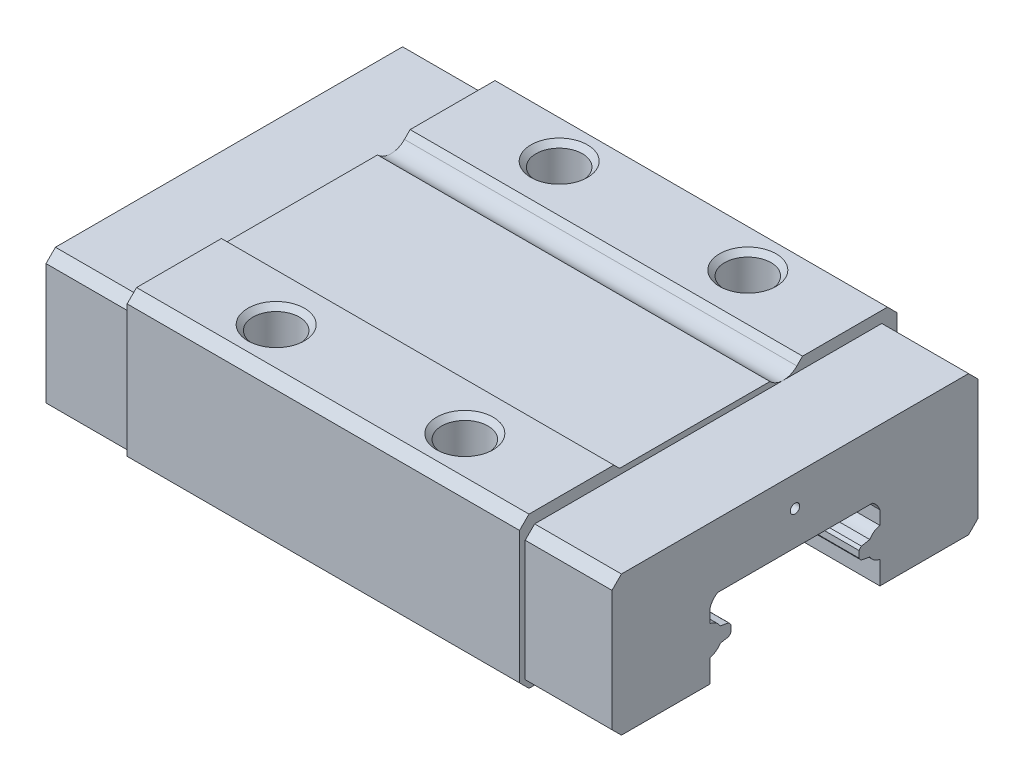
ISO-10303-21;
HEADER;
FILE_DESCRIPTION(('STEP AP214'),'2;1');
FILE_NAME('part.step','',(''),(''),'','','');
FILE_SCHEMA(('AUTOMOTIVE_DESIGN { 1 0 10303 214 1 1 1 1 }'));
ENDSEC;
DATA;
#1=APPLICATION_CONTEXT('core data for automotive mechanical design processes');
#2=APPLICATION_PROTOCOL_DEFINITION('international standard','automotive_design',2000,#1);
#3=PRODUCT_CONTEXT('',#1,'mechanical');
#4=PRODUCT('Part','Part','',(#3));
#5=PRODUCT_RELATED_PRODUCT_CATEGORY('part','',(#4));
#6=PRODUCT_DEFINITION_FORMATION('','',#4);
#7=PRODUCT_DEFINITION_CONTEXT('part definition',#1,'design');
#8=PRODUCT_DEFINITION('design','',#6,#7);
#9=PRODUCT_DEFINITION_SHAPE('','',#8);
#10=(LENGTH_UNIT() NAMED_UNIT(*) SI_UNIT(.MILLI.,.METRE.));
#11=(NAMED_UNIT(*) PLANE_ANGLE_UNIT() SI_UNIT($,.RADIAN.));
#12=(NAMED_UNIT(*) SI_UNIT($,.STERADIAN.) SOLID_ANGLE_UNIT());
#13=UNCERTAINTY_MEASURE_WITH_UNIT(LENGTH_MEASURE(1.E-05),#10,'distance_accuracy_value','');
#14=(GEOMETRIC_REPRESENTATION_CONTEXT(3) GLOBAL_UNCERTAINTY_ASSIGNED_CONTEXT((#13)) GLOBAL_UNIT_ASSIGNED_CONTEXT((#10,
#11,#12)) REPRESENTATION_CONTEXT('',''));
#15=CARTESIAN_POINT('',(0.,0.,0.));
#16=DIRECTION('',(0.,0.,1.));
#17=DIRECTION('',(1.,0.,0.));
#18=AXIS2_PLACEMENT_3D('',#15,#16,#17);
#19=CARTESIAN_POINT('',(25.,5.95985215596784,-7.5));
#20=DIRECTION('',(0.,1.,0.));
#21=DIRECTION('',(0.,0.,1.));
#22=AXIS2_PLACEMENT_3D('',#19,#20,#21);
#23=CONICAL_SURFACE('',#22,1.22950000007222,1.04719755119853);
#24=CARTESIAN_POINT('',(25.,5.24999999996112,-7.49999999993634));
#25=VERTEX_POINT('',#24);
#26=VERTEX_LOOP('',#25);
#27=FACE_BOUND('',#26,.T.);
#28=CARTESIAN_POINT('',(25.,5.95985215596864,-7.5));
#29=DIRECTION('',(0.,-1.,0.));
#30=DIRECTION('',(0.,0.,-1.));
#31=AXIS2_PLACEMENT_3D('',#28,#29,#30);
#32=CIRCLE('',#31,1.2295);
#33=CARTESIAN_POINT('',(25.,5.95985215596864,-8.7295));
#34=VERTEX_POINT('',#33);
#35=EDGE_CURVE('E379',#34,#34,#32,.F.);
#36=ORIENTED_EDGE('',*,*,#35,.T.);
#37=EDGE_LOOP('',(#36));
#38=FACE_BOUND('',#37,.T.);
#39=ADVANCED_FACE('F16',(#27,#38),#23,.F.);
#40=CARTESIAN_POINT('',(15.,5.95985215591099,-7.5));
#41=DIRECTION('',(0.,1.,0.));
#42=DIRECTION('',(-1.,0.,0.));
#43=AXIS2_PLACEMENT_3D('',#40,#41,#42);
#44=CONICAL_SURFACE('',#43,1.22949999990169,1.04719755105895);
#45=CARTESIAN_POINT('',(15.,5.24999999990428,-7.50000000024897));
#46=VERTEX_POINT('',#45);
#47=VERTEX_LOOP('',#46);
#48=FACE_BOUND('',#47,.T.);
#49=CARTESIAN_POINT('',(15.,5.95985215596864,-7.5));
#50=DIRECTION('',(0.,-1.,0.));
#51=DIRECTION('',(0.,0.,-1.));
#52=AXIS2_PLACEMENT_3D('',#49,#50,#51);
#53=CIRCLE('',#52,1.2295);
#54=CARTESIAN_POINT('',(15.,5.95985215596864,-8.7295));
#55=VERTEX_POINT('',#54);
#56=EDGE_CURVE('E397',#55,#55,#53,.F.);
#57=ORIENTED_EDGE('',*,*,#56,.T.);
#58=EDGE_LOOP('',(#57));
#59=FACE_BOUND('',#58,.T.);
#60=ADVANCED_FACE('F1835',(#48,#59),#44,.F.);
#61=CARTESIAN_POINT('',(25.,5.95985215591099,7.5));
#62=DIRECTION('',(0.,1.,0.));
#63=DIRECTION('',(-1.,0.,0.));
#64=AXIS2_PLACEMENT_3D('',#61,#62,#63);
#65=CONICAL_SURFACE('',#64,1.22949999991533,1.04719755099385);
#66=CARTESIAN_POINT('',(25.,5.2499999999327,7.49999999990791));
#67=VERTEX_POINT('',#66);
#68=VERTEX_LOOP('',#67);
#69=FACE_BOUND('',#68,.T.);
#70=CARTESIAN_POINT('',(25.,5.95985215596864,7.5));
#71=DIRECTION('',(0.,-1.,0.));
#72=DIRECTION('',(0.,0.,-1.));
#73=AXIS2_PLACEMENT_3D('',#70,#71,#72);
#74=CIRCLE('',#73,1.2295);
#75=CARTESIAN_POINT('',(25.,5.95985215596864,6.2705));
#76=VERTEX_POINT('',#75);
#77=EDGE_CURVE('E394',#76,#76,#74,.F.);
#78=ORIENTED_EDGE('',*,*,#77,.T.);
#79=EDGE_LOOP('',(#78));
#80=FACE_BOUND('',#79,.T.);
#81=ADVANCED_FACE('F1826',(#69,#80),#65,.F.);
#82=CARTESIAN_POINT('',(15.,5.95985215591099,7.5));
#83=DIRECTION('',(0.,1.,0.));
#84=DIRECTION('',(-1.,0.,0.));
#85=AXIS2_PLACEMENT_3D('',#82,#83,#84);
#86=CONICAL_SURFACE('',#85,1.22949999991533,1.04719755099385);
#87=CARTESIAN_POINT('',(15.,5.2499999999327,7.49999999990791));
#88=VERTEX_POINT('',#87);
#89=VERTEX_LOOP('',#88);
#90=FACE_BOUND('',#89,.T.);
#91=CARTESIAN_POINT('',(15.,5.95985215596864,7.5));
#92=DIRECTION('',(0.,-1.,0.));
#93=DIRECTION('',(0.,0.,-1.));
#94=AXIS2_PLACEMENT_3D('',#91,#92,#93);
#95=CIRCLE('',#94,1.2295);
#96=CARTESIAN_POINT('',(15.,5.95985215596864,6.2705));
#97=VERTEX_POINT('',#96);
#98=EDGE_CURVE('E391',#97,#97,#95,.F.);
#99=ORIENTED_EDGE('',*,*,#98,.T.);
#100=EDGE_LOOP('',(#99));
#101=FACE_BOUND('',#100,.T.);
#102=ADVANCED_FACE('F1817',(#90,#101),#86,.F.);
#103=CARTESIAN_POINT('',(5.,4.17435595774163,3.4));
#104=DIRECTION('',(0.,0.,-1.));
#105=DIRECTION('',(-1.,0.,0.));
#106=AXIS2_PLACEMENT_3D('',#103,#104,#105);
#107=PLANE('',#106);
#108=DIRECTION('',(0.,1.,0.));
#109=VECTOR('',#108,1.);
#110=CARTESIAN_POINT('',(5.,4.17435595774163,3.4));
#111=LINE('',#110,#109);
#112=CARTESIAN_POINT('',(5.,3.82564404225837,3.4));
#113=VERTEX_POINT('',#112);
#114=CARTESIAN_POINT('',(5.,4.17435595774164,3.4));
#115=VERTEX_POINT('',#114);
#116=EDGE_CURVE('E377',#113,#115,#111,.T.);
#117=ORIENTED_EDGE('',*,*,#116,.T.);
#118=DIRECTION('',(-1.,0.,0.));
#119=VECTOR('',#118,1.);
#120=CARTESIAN_POINT('',(5.,4.17435595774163,3.4));
#121=LINE('',#120,#119);
#122=CARTESIAN_POINT('',(35.,4.17435595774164,3.4));
#123=VERTEX_POINT('',#122);
#124=EDGE_CURVE('E373',#123,#115,#121,.T.);
#125=ORIENTED_EDGE('',*,*,#124,.F.);
#126=DIRECTION('',(0.,1.,0.));
#127=VECTOR('',#126,1.);
#128=CARTESIAN_POINT('',(35.,4.17435595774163,3.4));
#129=LINE('',#128,#127);
#130=CARTESIAN_POINT('',(35.,3.82564404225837,3.4));
#131=VERTEX_POINT('',#130);
#132=EDGE_CURVE('E380',#123,#131,#129,.F.);
#133=ORIENTED_EDGE('',*,*,#132,.T.);
#134=DIRECTION('',(-1.,0.,0.));
#135=VECTOR('',#134,1.);
#136=CARTESIAN_POINT('',(5.,3.82564404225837,3.4));
#137=LINE('',#136,#135);
#138=EDGE_CURVE('E386',#113,#131,#137,.F.);
#139=ORIENTED_EDGE('',*,*,#138,.F.);
#140=EDGE_LOOP('',(#117,#125,#133,#139));
#141=FACE_BOUND('',#140,.T.);
#142=ADVANCED_FACE('F1173',(#141),#107,.T.);
#143=CARTESIAN_POINT('',(25.,7.84467607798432,-7.5));
#144=DIRECTION('',(0.,-1.,0.));
#145=DIRECTION('',(0.,0.,-1.));
#146=AXIS2_PLACEMENT_3D('',#143,#144,#145);
#147=CYLINDRICAL_SURFACE('',#146,1.2295);
#148=CARTESIAN_POINT('',(25.,9.72950000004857,-7.5));
#149=DIRECTION('',(0.,1.,0.));
#150=DIRECTION('',(0.,0.,-1.));
#151=AXIS2_PLACEMENT_3D('',#148,#149,#150);
#152=CIRCLE('',#151,1.22950000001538);
#153=CARTESIAN_POINT('',(25.,9.72950000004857,-8.72950000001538));
#154=VERTEX_POINT('',#153);
#155=EDGE_CURVE('E369',#154,#154,#152,.T.);
#156=ORIENTED_EDGE('',*,*,#155,.T.);
#157=EDGE_LOOP('',(#156));
#158=FACE_BOUND('',#157,.T.);
#159=ORIENTED_EDGE('',*,*,#35,.F.);
#160=EDGE_LOOP('',(#159));
#161=FACE_BOUND('',#160,.T.);
#162=ADVANCED_FACE('F1798',(#158,#161),#147,.F.);
#163=CARTESIAN_POINT('',(15.,7.84467607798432,-7.5));
#164=DIRECTION('',(0.,-1.,0.));
#165=DIRECTION('',(0.,0.,-1.));
#166=AXIS2_PLACEMENT_3D('',#163,#164,#165);
#167=CYLINDRICAL_SURFACE('',#166,1.2295);
#168=CARTESIAN_POINT('',(15.,9.72950000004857,-7.5));
#169=DIRECTION('',(0.,1.,0.));
#170=DIRECTION('',(0.,0.,-1.));
#171=AXIS2_PLACEMENT_3D('',#168,#169,#170);
#172=CIRCLE('',#171,1.22950000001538);
#173=CARTESIAN_POINT('',(15.,9.72950000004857,-8.72950000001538));
#174=VERTEX_POINT('',#173);
#175=EDGE_CURVE('E337',#174,#174,#172,.T.);
#176=ORIENTED_EDGE('',*,*,#175,.T.);
#177=EDGE_LOOP('',(#176));
#178=FACE_BOUND('',#177,.T.);
#179=ORIENTED_EDGE('',*,*,#56,.F.);
#180=EDGE_LOOP('',(#179));
#181=FACE_BOUND('',#180,.T.);
#182=ADVANCED_FACE('F1788',(#178,#181),#167,.F.);
#183=CARTESIAN_POINT('',(25.,7.84467607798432,7.5));
#184=DIRECTION('',(0.,-1.,0.));
#185=DIRECTION('',(0.,0.,-1.));
#186=AXIS2_PLACEMENT_3D('',#183,#184,#185);
#187=CYLINDRICAL_SURFACE('',#186,1.2295);
#188=CARTESIAN_POINT('',(25.,9.72949999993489,7.5));
#189=DIRECTION('',(0.,1.,0.));
#190=DIRECTION('',(0.,0.,-1.));
#191=AXIS2_PLACEMENT_3D('',#188,#189,#190);
#192=CIRCLE('',#191,1.22949999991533);
#193=CARTESIAN_POINT('',(25.,9.72949999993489,6.27050000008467));
#194=VERTEX_POINT('',#193);
#195=EDGE_CURVE('E490',#194,#194,#192,.T.);
#196=ORIENTED_EDGE('',*,*,#195,.T.);
#197=EDGE_LOOP('',(#196));
#198=FACE_BOUND('',#197,.T.);
#199=ORIENTED_EDGE('',*,*,#77,.F.);
#200=EDGE_LOOP('',(#199));
#201=FACE_BOUND('',#200,.T.);
#202=ADVANCED_FACE('F1778',(#198,#201),#187,.F.);
#203=CARTESIAN_POINT('',(15.,7.84467607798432,7.5));
#204=DIRECTION('',(0.,-1.,0.));
#205=DIRECTION('',(0.,0.,-1.));
#206=AXIS2_PLACEMENT_3D('',#203,#204,#205);
#207=CYLINDRICAL_SURFACE('',#206,1.2295);
#208=CARTESIAN_POINT('',(15.,9.72949999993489,7.5));
#209=DIRECTION('',(0.,1.,0.));
#210=DIRECTION('',(0.,0.,-1.));
#211=AXIS2_PLACEMENT_3D('',#208,#209,#210);
#212=CIRCLE('',#211,1.22949999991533);
#213=CARTESIAN_POINT('',(15.,9.72949999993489,6.27050000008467));
#214=VERTEX_POINT('',#213);
#215=EDGE_CURVE('E549',#214,#214,#212,.T.);
#216=ORIENTED_EDGE('',*,*,#215,.T.);
#217=EDGE_LOOP('',(#216));
#218=FACE_BOUND('',#217,.T.);
#219=ORIENTED_EDGE('',*,*,#98,.F.);
#220=EDGE_LOOP('',(#219));
#221=FACE_BOUND('',#220,.T.);
#222=ADVANCED_FACE('F1769',(#218,#221),#207,.F.);
#223=CARTESIAN_POINT('',(5.,4.,3.76));
#224=DIRECTION('',(-1.,0.,0.));
#225=DIRECTION('',(0.,0.,1.));
#226=AXIS2_PLACEMENT_3D('',#223,#224,#225);
#227=CYLINDRICAL_SURFACE('',#226,0.400000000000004);
#228=CARTESIAN_POINT('',(5.,4.,3.76));
#229=DIRECTION('',(-1.,0.,0.));
#230=DIRECTION('',(0.,0.,1.));
#231=AXIS2_PLACEMENT_3D('',#228,#229,#230);
#232=CIRCLE('',#231,0.400000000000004);
#233=CARTESIAN_POINT('',(5.,3.68,3.52));
#234=VERTEX_POINT('',#233);
#235=EDGE_CURVE('E390',#234,#113,#232,.F.);
#236=ORIENTED_EDGE('',*,*,#235,.T.);
#237=ORIENTED_EDGE('',*,*,#138,.T.);
#238=CARTESIAN_POINT('',(35.,4.,3.76));
#239=DIRECTION('',(-1.,0.,0.));
#240=DIRECTION('',(0.,0.,1.));
#241=AXIS2_PLACEMENT_3D('',#238,#239,#240);
#242=CIRCLE('',#241,0.400000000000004);
#243=CARTESIAN_POINT('',(35.,3.68,3.52));
#244=VERTEX_POINT('',#243);
#245=EDGE_CURVE('E20',#131,#244,#242,.T.);
#246=ORIENTED_EDGE('',*,*,#245,.T.);
#247=DIRECTION('',(1.,0.,0.));
#248=VECTOR('',#247,1.);
#249=CARTESIAN_POINT('',(5.,3.68,3.52));
#250=LINE('',#249,#248);
#251=EDGE_CURVE('E511',#234,#244,#250,.T.);
#252=ORIENTED_EDGE('',*,*,#251,.F.);
#253=EDGE_LOOP('',(#236,#237,#246,#252));
#254=FACE_BOUND('',#253,.T.);
#255=ADVANCED_FACE('F510',(#254),#227,.T.);
#256=CARTESIAN_POINT('',(5.,4.,-3.76));
#257=DIRECTION('',(-1.,0.,0.));
#258=DIRECTION('',(0.,0.,1.));
#259=AXIS2_PLACEMENT_3D('',#256,#257,#258);
#260=CYLINDRICAL_SURFACE('',#259,0.400000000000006);
#261=CARTESIAN_POINT('',(5.,4.,-3.76));
#262=DIRECTION('',(-1.,0.,0.));
#263=DIRECTION('',(0.,0.,1.));
#264=AXIS2_PLACEMENT_3D('',#261,#262,#263);
#265=CIRCLE('',#264,0.400000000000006);
#266=CARTESIAN_POINT('',(5.,3.82564404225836,-3.4));
#267=VERTEX_POINT('',#266);
#268=CARTESIAN_POINT('',(5.,3.68,-3.51999999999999));
#269=VERTEX_POINT('',#268);
#270=EDGE_CURVE('E502',#267,#269,#265,.F.);
#271=ORIENTED_EDGE('',*,*,#270,.T.);
#272=DIRECTION('',(1.,0.,0.));
#273=VECTOR('',#272,1.);
#274=CARTESIAN_POINT('',(5.,3.68,-3.52));
#275=LINE('',#274,#273);
#276=CARTESIAN_POINT('',(35.,3.68,-3.51999999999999));
#277=VERTEX_POINT('',#276);
#278=EDGE_CURVE('E524',#277,#269,#275,.F.);
#279=ORIENTED_EDGE('',*,*,#278,.F.);
#280=CARTESIAN_POINT('',(35.,4.,-3.76));
#281=DIRECTION('',(-1.,0.,0.));
#282=DIRECTION('',(0.,0.,1.));
#283=AXIS2_PLACEMENT_3D('',#280,#281,#282);
#284=CIRCLE('',#283,0.400000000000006);
#285=CARTESIAN_POINT('',(35.,3.82564404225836,-3.4));
#286=VERTEX_POINT('',#285);
#287=EDGE_CURVE('E389',#277,#286,#284,.T.);
#288=ORIENTED_EDGE('',*,*,#287,.T.);
#289=DIRECTION('',(1.,0.,0.));
#290=VECTOR('',#289,1.);
#291=CARTESIAN_POINT('',(5.,3.82564404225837,-3.4));
#292=LINE('',#291,#290);
#293=EDGE_CURVE('E382',#267,#286,#292,.T.);
#294=ORIENTED_EDGE('',*,*,#293,.F.);
#295=EDGE_LOOP('',(#271,#279,#288,#294));
#296=FACE_BOUND('',#295,.T.);
#297=ADVANCED_FACE('F932',(#296),#260,.T.);
#298=CARTESIAN_POINT('',(5.,3.82564404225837,-3.4));
#299=DIRECTION('',(0.,0.,1.));
#300=DIRECTION('',(1.,0.,0.));
#301=AXIS2_PLACEMENT_3D('',#298,#299,#300);
#302=PLANE('',#301);
#303=DIRECTION('',(0.,1.,0.));
#304=VECTOR('',#303,1.);
#305=CARTESIAN_POINT('',(5.,3.82564404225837,-3.4));
#306=LINE('',#305,#304);
#307=CARTESIAN_POINT('',(5.,4.17435595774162,-3.4));
#308=VERTEX_POINT('',#307);
#309=EDGE_CURVE('E385',#308,#267,#306,.F.);
#310=ORIENTED_EDGE('',*,*,#309,.T.);
#311=ORIENTED_EDGE('',*,*,#293,.T.);
#312=DIRECTION('',(0.,1.,0.));
#313=VECTOR('',#312,1.);
#314=CARTESIAN_POINT('',(35.,3.82564404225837,-3.4));
#315=LINE('',#314,#313);
#316=CARTESIAN_POINT('',(35.,4.17435595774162,-3.4));
#317=VERTEX_POINT('',#316);
#318=EDGE_CURVE('E504',#286,#317,#315,.T.);
#319=ORIENTED_EDGE('',*,*,#318,.T.);
#320=DIRECTION('',(-1.,0.,0.));
#321=VECTOR('',#320,1.);
#322=CARTESIAN_POINT('',(5.,4.17435595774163,-3.4));
#323=LINE('',#322,#321);
#324=EDGE_CURVE('E479',#308,#317,#323,.F.);
#325=ORIENTED_EDGE('',*,*,#324,.F.);
#326=EDGE_LOOP('',(#310,#311,#319,#325));
#327=FACE_BOUND('',#326,.T.);
#328=ADVANCED_FACE('F919',(#327),#302,.T.);
#329=CARTESIAN_POINT('',(5.,4.,3.76));
#330=DIRECTION('',(-1.,0.,0.));
#331=DIRECTION('',(0.,0.,1.));
#332=AXIS2_PLACEMENT_3D('',#329,#330,#331);
#333=CYLINDRICAL_SURFACE('',#332,0.400000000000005);
#334=CARTESIAN_POINT('',(5.,4.,3.76));
#335=DIRECTION('',(-1.,0.,0.));
#336=DIRECTION('',(0.,0.,1.));
#337=AXIS2_PLACEMENT_3D('',#334,#335,#336);
#338=CIRCLE('',#337,0.400000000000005);
#339=CARTESIAN_POINT('',(5.,4.32,3.52));
#340=VERTEX_POINT('',#339);
#341=EDGE_CURVE('E372',#115,#340,#338,.F.);
#342=ORIENTED_EDGE('',*,*,#341,.T.);
#343=DIRECTION('',(1.,0.,0.));
#344=VECTOR('',#343,1.);
#345=CARTESIAN_POINT('',(5.,4.32,3.52));
#346=LINE('',#345,#344);
#347=CARTESIAN_POINT('',(35.,4.32,3.52));
#348=VERTEX_POINT('',#347);
#349=EDGE_CURVE('E863',#348,#340,#346,.F.);
#350=ORIENTED_EDGE('',*,*,#349,.F.);
#351=CARTESIAN_POINT('',(35.,4.,3.76));
#352=DIRECTION('',(-1.,0.,0.));
#353=DIRECTION('',(0.,0.,1.));
#354=AXIS2_PLACEMENT_3D('',#351,#352,#353);
#355=CIRCLE('',#354,0.400000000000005);
#356=EDGE_CURVE('E376',#348,#123,#355,.T.);
#357=ORIENTED_EDGE('',*,*,#356,.T.);
#358=ORIENTED_EDGE('',*,*,#124,.T.);
#359=EDGE_LOOP('',(#342,#350,#357,#358));
#360=FACE_BOUND('',#359,.T.);
#361=ADVANCED_FACE('F1170',(#360),#333,.T.);
#362=CARTESIAN_POINT('',(25.,9.99999999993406,-7.5));
#363=DIRECTION('',(0.,1.,0.));
#364=DIRECTION('',(0.,0.,1.));
#365=AXIS2_PLACEMENT_3D('',#362,#363,#364);
#366=CONICAL_SURFACE('',#365,1.49999999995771,0.785398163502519);
#367=CARTESIAN_POINT('',(25.,10.0000000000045,-7.5));
#368=DIRECTION('',(0.,1.,0.));
#369=DIRECTION('',(0.,0.,1.));
#370=AXIS2_PLACEMENT_3D('',#367,#368,#369);
#371=CIRCLE('',#370,1.50000000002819);
#372=CARTESIAN_POINT('',(25.,10.0000000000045,-5.99999999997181));
#373=VERTEX_POINT('',#372);
#374=EDGE_CURVE('E472',#373,#373,#371,.F.);
#375=ORIENTED_EDGE('',*,*,#374,.F.);
#376=EDGE_LOOP('',(#375));
#377=FACE_BOUND('',#376,.T.);
#378=ORIENTED_EDGE('',*,*,#155,.F.);
#379=EDGE_LOOP('',(#378));
#380=FACE_BOUND('',#379,.T.);
#381=ADVANCED_FACE('F1726',(#377,#380),#366,.F.);
#382=CARTESIAN_POINT('',(15.,9.99999999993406,-7.5));
#383=DIRECTION('',(0.,1.,0.));
#384=DIRECTION('',(0.,0.,1.));
#385=AXIS2_PLACEMENT_3D('',#382,#383,#384);
#386=CONICAL_SURFACE('',#385,1.49999999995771,0.785398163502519);
#387=CARTESIAN_POINT('',(15.,10.0000000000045,-7.5));
#388=DIRECTION('',(0.,1.,0.));
#389=DIRECTION('',(0.,0.,1.));
#390=AXIS2_PLACEMENT_3D('',#387,#388,#389);
#391=CIRCLE('',#390,1.50000000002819);
#392=CARTESIAN_POINT('',(15.,10.0000000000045,-5.99999999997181));
#393=VERTEX_POINT('',#392);
#394=EDGE_CURVE('E346',#393,#393,#391,.F.);
#395=ORIENTED_EDGE('',*,*,#394,.F.);
#396=EDGE_LOOP('',(#395));
#397=FACE_BOUND('',#396,.T.);
#398=ORIENTED_EDGE('',*,*,#175,.F.);
#399=EDGE_LOOP('',(#398));
#400=FACE_BOUND('',#399,.T.);
#401=ADVANCED_FACE('F1717',(#397,#400),#386,.F.);
#402=CARTESIAN_POINT('',(5.,10.,-9.5));
#403=DIRECTION('',(0.,0.707106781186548,-0.707106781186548));
#404=DIRECTION('',(0.,0.707106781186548,0.707106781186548));
#405=AXIS2_PLACEMENT_3D('',#402,#403,#404);
#406=PLANE('',#405);
#407=DIRECTION('',(0.,0.707106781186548,0.707106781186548));
#408=VECTOR('',#407,1.);
#409=CARTESIAN_POINT('',(9.6,10.,-9.5));
#410=LINE('',#409,#408);
#411=CARTESIAN_POINT('',(9.6,9.5,-10.));
#412=VERTEX_POINT('',#411);
#413=CARTESIAN_POINT('',(9.6,10.,-9.5));
#414=VERTEX_POINT('',#413);
#415=EDGE_CURVE('E336',#412,#414,#410,.T.);
#416=ORIENTED_EDGE('',*,*,#415,.T.);
#417=DIRECTION('',(1.,0.,0.));
#418=VECTOR('',#417,1.);
#419=CARTESIAN_POINT('',(5.,10.,-9.5));
#420=LINE('',#419,#418);
#421=CARTESIAN_POINT('',(30.4,10.,-9.5));
#422=VERTEX_POINT('',#421);
#423=EDGE_CURVE('E340',#422,#414,#420,.F.);
#424=ORIENTED_EDGE('',*,*,#423,.F.);
#425=DIRECTION('',(0.,0.707106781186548,0.707106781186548));
#426=VECTOR('',#425,1.);
#427=CARTESIAN_POINT('',(30.4,10.,-9.5));
#428=LINE('',#427,#426);
#429=CARTESIAN_POINT('',(30.4,9.5,-10.));
#430=VERTEX_POINT('',#429);
#431=EDGE_CURVE('E325',#422,#430,#428,.F.);
#432=ORIENTED_EDGE('',*,*,#431,.T.);
#433=DIRECTION('',(-1.,0.,0.));
#434=VECTOR('',#433,1.);
#435=CARTESIAN_POINT('',(5.,9.5,-10.));
#436=LINE('',#435,#434);
#437=EDGE_CURVE('E475',#412,#430,#436,.F.);
#438=ORIENTED_EDGE('',*,*,#437,.F.);
#439=EDGE_LOOP('',(#416,#424,#432,#438));
#440=FACE_BOUND('',#439,.T.);
#441=ADVANCED_FACE('F341',(#440),#406,.T.);
#442=CARTESIAN_POINT('',(5.,9.7,-4.69997142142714));
#443=DIRECTION('',(0.,0.707140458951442,0.707073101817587));
#444=DIRECTION('',(0.,-0.707073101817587,0.707140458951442));
#445=AXIS2_PLACEMENT_3D('',#442,#443,#444);
#446=PLANE('',#445);
#447=DIRECTION('',(0.,-0.707073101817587,0.707140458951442));
#448=VECTOR('',#447,1.);
#449=CARTESIAN_POINT('',(9.6,9.7,-4.69997142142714));
#450=LINE('',#449,#448);
#451=CARTESIAN_POINT('',(9.6,10.,-5.));
#452=VERTEX_POINT('',#451);
#453=CARTESIAN_POINT('',(9.6,9.70000000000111,-4.69997142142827));
#454=VERTEX_POINT('',#453);
#455=EDGE_CURVE('E498',#452,#454,#450,.T.);
#456=ORIENTED_EDGE('',*,*,#455,.T.);
#457=DIRECTION('',(-1.,0.,0.));
#458=VECTOR('',#457,1.);
#459=CARTESIAN_POINT('',(5.,9.69999999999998,-4.69997142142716));
#460=LINE('',#459,#458);
#461=CARTESIAN_POINT('',(30.4,9.70000000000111,-4.69997142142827));
#462=VERTEX_POINT('',#461);
#463=EDGE_CURVE('E491',#454,#462,#460,.F.);
#464=ORIENTED_EDGE('',*,*,#463,.T.);
#465=DIRECTION('',(0.,-0.707073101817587,0.707140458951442));
#466=VECTOR('',#465,1.);
#467=CARTESIAN_POINT('',(30.4,9.7,-4.69997142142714));
#468=LINE('',#467,#466);
#469=CARTESIAN_POINT('',(30.4,10.,-5.));
#470=VERTEX_POINT('',#469);
#471=EDGE_CURVE('E557',#462,#470,#468,.F.);
#472=ORIENTED_EDGE('',*,*,#471,.T.);
#473=DIRECTION('',(1.,0.,0.));
#474=VECTOR('',#473,1.);
#475=CARTESIAN_POINT('',(5.,10.,-5.));
#476=LINE('',#475,#474);
#477=EDGE_CURVE('E345',#452,#470,#476,.T.);
#478=ORIENTED_EDGE('',*,*,#477,.F.);
#479=EDGE_LOOP('',(#456,#464,#472,#478));
#480=FACE_BOUND('',#479,.T.);
#481=ADVANCED_FACE('F1699',(#480),#446,.T.);
#482=CARTESIAN_POINT('',(5.,10.4000340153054,-3.98581428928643));
#483=DIRECTION('',(-1.,0.,0.));
#484=DIRECTION('',(0.,0.,1.));
#485=AXIS2_PLACEMENT_3D('',#482,#483,#484);
#486=CYLINDRICAL_SURFACE('',#485,1.00003401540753);
#487=ORIENTED_EDGE('',*,*,#463,.F.);
#488=CARTESIAN_POINT('',(9.6,10.4000340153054,-3.98581428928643));
#489=DIRECTION('',(-1.,0.,0.));
#490=DIRECTION('',(0.,0.,1.));
#491=AXIS2_PLACEMENT_3D('',#488,#489,#490);
#492=CIRCLE('',#491,1.00003401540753);
#493=CARTESIAN_POINT('',(9.6,9.39999999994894,-3.98581428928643));
#494=VERTEX_POINT('',#493);
#495=EDGE_CURVE('E492',#494,#454,#492,.F.);
#496=ORIENTED_EDGE('',*,*,#495,.F.);
#497=CARTESIAN_POINT('',(9.6,10.4000340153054,-3.98581428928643));
#498=DIRECTION('',(-1.,0.,0.));
#499=DIRECTION('',(0.,0.,1.));
#500=AXIS2_PLACEMENT_3D('',#497,#498,#499);
#501=CIRCLE('',#500,1.00003401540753);
#502=CARTESIAN_POINT('',(9.6,9.7,-3.2716571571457));
#503=VERTEX_POINT('',#502);
#504=EDGE_CURVE('E494',#503,#494,#501,.F.);
#505=ORIENTED_EDGE('',*,*,#504,.F.);
#506=DIRECTION('',(1.,0.,0.));
#507=VECTOR('',#506,1.);
#508=CARTESIAN_POINT('',(5.,9.7,-3.27165715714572));
#509=LINE('',#508,#507);
#510=CARTESIAN_POINT('',(30.4,9.7,-3.2716571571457));
#511=VERTEX_POINT('',#510);
#512=EDGE_CURVE('E566',#511,#503,#509,.F.);
#513=ORIENTED_EDGE('',*,*,#512,.F.);
#514=CARTESIAN_POINT('',(30.4,10.4000340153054,-3.98581428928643));
#515=DIRECTION('',(-1.,0.,0.));
#516=DIRECTION('',(0.,0.,1.));
#517=AXIS2_PLACEMENT_3D('',#514,#515,#516);
#518=CIRCLE('',#517,1.00003401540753);
#519=CARTESIAN_POINT('',(30.4,9.39999999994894,-3.98581428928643));
#520=VERTEX_POINT('',#519);
#521=EDGE_CURVE('E496',#520,#511,#518,.T.);
#522=ORIENTED_EDGE('',*,*,#521,.F.);
#523=CARTESIAN_POINT('',(30.4,10.4000340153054,-3.98581428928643));
#524=DIRECTION('',(-1.,0.,0.));
#525=DIRECTION('',(0.,0.,1.));
#526=AXIS2_PLACEMENT_3D('',#523,#524,#525);
#527=CIRCLE('',#526,1.00003401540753);
#528=EDGE_CURVE('E488',#462,#520,#527,.T.);
#529=ORIENTED_EDGE('',*,*,#528,.F.);
#530=EDGE_LOOP('',(#487,#496,#505,#513,#522,#529));
#531=FACE_BOUND('',#530,.T.);
#532=ADVANCED_FACE('F1085',(#531),#486,.F.);
#533=CARTESIAN_POINT('',(25.,9.99999999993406,7.5));
#534=DIRECTION('',(0.,1.,0.));
#535=DIRECTION('',(0.,0.,1.));
#536=AXIS2_PLACEMENT_3D('',#533,#534,#535);
#537=CONICAL_SURFACE('',#536,1.49999999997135,0.785398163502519);
#538=CARTESIAN_POINT('',(25.,9.99999999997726,7.5));
#539=DIRECTION('',(0.,1.,0.));
#540=DIRECTION('',(0.,0.,1.));
#541=AXIS2_PLACEMENT_3D('',#538,#539,#540);
#542=CIRCLE('',#541,1.50000000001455);
#543=CARTESIAN_POINT('',(25.,9.99999999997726,9.00000000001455));
#544=VERTEX_POINT('',#543);
#545=EDGE_CURVE('E466',#544,#544,#542,.F.);
#546=ORIENTED_EDGE('',*,*,#545,.F.);
#547=EDGE_LOOP('',(#546));
#548=FACE_BOUND('',#547,.T.);
#549=ORIENTED_EDGE('',*,*,#195,.F.);
#550=EDGE_LOOP('',(#549));
#551=FACE_BOUND('',#550,.T.);
#552=ADVANCED_FACE('F1680',(#548,#551),#537,.F.);
#553=CARTESIAN_POINT('',(15.,9.99999999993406,7.5));
#554=DIRECTION('',(0.,1.,0.));
#555=DIRECTION('',(0.,0.,1.));
#556=AXIS2_PLACEMENT_3D('',#553,#554,#555);
#557=CONICAL_SURFACE('',#556,1.49999999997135,0.785398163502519);
#558=CARTESIAN_POINT('',(15.,9.99999999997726,7.5));
#559=DIRECTION('',(0.,1.,0.));
#560=DIRECTION('',(0.,0.,1.));
#561=AXIS2_PLACEMENT_3D('',#558,#559,#560);
#562=CIRCLE('',#561,1.50000000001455);
#563=CARTESIAN_POINT('',(15.,9.99999999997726,9.00000000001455));
#564=VERTEX_POINT('',#563);
#565=EDGE_CURVE('E462',#564,#564,#562,.F.);
#566=ORIENTED_EDGE('',*,*,#565,.F.);
#567=EDGE_LOOP('',(#566));
#568=FACE_BOUND('',#567,.T.);
#569=ORIENTED_EDGE('',*,*,#215,.F.);
#570=EDGE_LOOP('',(#569));
#571=FACE_BOUND('',#570,.T.);
#572=ADVANCED_FACE('F1671',(#568,#571),#557,.F.);
#573=CARTESIAN_POINT('',(5.,10.,5.));
#574=DIRECTION('',(0.,0.707106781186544,-0.707106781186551));
#575=DIRECTION('',(0.,0.707106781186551,0.707106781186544));
#576=AXIS2_PLACEMENT_3D('',#573,#574,#575);
#577=PLANE('',#576);
#578=DIRECTION('',(0.,0.707106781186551,0.707106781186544));
#579=VECTOR('',#578,1.);
#580=CARTESIAN_POINT('',(9.6,10.,5.));
#581=LINE('',#580,#579);
#582=CARTESIAN_POINT('',(9.6,9.7,4.7));
#583=VERTEX_POINT('',#582);
#584=CARTESIAN_POINT('',(9.6,10.,5.));
#585=VERTEX_POINT('',#584);
#586=EDGE_CURVE('E898',#583,#585,#581,.T.);
#587=ORIENTED_EDGE('',*,*,#586,.T.);
#588=DIRECTION('',(1.,0.,0.));
#589=VECTOR('',#588,1.);
#590=CARTESIAN_POINT('',(5.,10.,5.));
#591=LINE('',#590,#589);
#592=CARTESIAN_POINT('',(30.4,10.,5.));
#593=VERTEX_POINT('',#592);
#594=EDGE_CURVE('E465',#593,#585,#591,.F.);
#595=ORIENTED_EDGE('',*,*,#594,.F.);
#596=DIRECTION('',(0.,0.707106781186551,0.707106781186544));
#597=VECTOR('',#596,1.);
#598=CARTESIAN_POINT('',(30.4,10.,5.));
#599=LINE('',#598,#597);
#600=CARTESIAN_POINT('',(30.4,9.7,4.7));
#601=VERTEX_POINT('',#600);
#602=EDGE_CURVE('E552',#593,#601,#599,.F.);
#603=ORIENTED_EDGE('',*,*,#602,.T.);
#604=DIRECTION('',(1.,0.,0.));
#605=VECTOR('',#604,1.);
#606=CARTESIAN_POINT('',(5.,9.7,4.7));
#607=LINE('',#606,#605);
#608=EDGE_CURVE('E469',#583,#601,#607,.T.);
#609=ORIENTED_EDGE('',*,*,#608,.F.);
#610=EDGE_LOOP('',(#587,#595,#603,#609));
#611=FACE_BOUND('',#610,.T.);
#612=ADVANCED_FACE('F1077',(#611),#577,.T.);
#613=CARTESIAN_POINT('',(5.,9.5,10.));
#614=DIRECTION('',(0.,0.707106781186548,0.707106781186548));
#615=DIRECTION('',(0.,-0.707106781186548,0.707106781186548));
#616=AXIS2_PLACEMENT_3D('',#613,#614,#615);
#617=PLANE('',#616);
#618=DIRECTION('',(0.,-0.707106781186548,0.707106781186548));
#619=VECTOR('',#618,1.);
#620=CARTESIAN_POINT('',(9.6,9.5,10.));
#621=LINE('',#620,#619);
#622=CARTESIAN_POINT('',(9.6,10.,9.5));
#623=VERTEX_POINT('',#622);
#624=CARTESIAN_POINT('',(9.6,9.5,10.));
#625=VERTEX_POINT('',#624);
#626=EDGE_CURVE('E897',#623,#625,#621,.T.);
#627=ORIENTED_EDGE('',*,*,#626,.T.);
#628=DIRECTION('',(1.,0.,0.));
#629=VECTOR('',#628,1.);
#630=CARTESIAN_POINT('',(5.,9.5,10.));
#631=LINE('',#630,#629);
#632=CARTESIAN_POINT('',(30.4,9.5,10.));
#633=VERTEX_POINT('',#632);
#634=EDGE_CURVE('E461',#633,#625,#631,.F.);
#635=ORIENTED_EDGE('',*,*,#634,.F.);
#636=DIRECTION('',(0.,-0.707106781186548,0.707106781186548));
#637=VECTOR('',#636,1.);
#638=CARTESIAN_POINT('',(30.4,9.5,10.));
#639=LINE('',#638,#637);
#640=CARTESIAN_POINT('',(30.4,10.,9.5));
#641=VERTEX_POINT('',#640);
#642=EDGE_CURVE('E900',#633,#641,#639,.F.);
#643=ORIENTED_EDGE('',*,*,#642,.T.);
#644=DIRECTION('',(1.,0.,0.));
#645=VECTOR('',#644,1.);
#646=CARTESIAN_POINT('',(5.,10.,9.5));
#647=LINE('',#646,#645);
#648=EDGE_CURVE('E532',#623,#641,#647,.T.);
#649=ORIENTED_EDGE('',*,*,#648,.F.);
#650=EDGE_LOOP('',(#627,#635,#643,#649));
#651=FACE_BOUND('',#650,.T.);
#652=ADVANCED_FACE('F1040',(#651),#617,.T.);
#653=CARTESIAN_POINT('',(5.,3.68,3.52));
#654=DIRECTION('',(0.,-0.984176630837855,-0.177190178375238));
#655=DIRECTION('',(0.,0.177190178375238,-0.984176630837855));
#656=AXIS2_PLACEMENT_3D('',#653,#654,#655);
#657=PLANE('',#656);
#658=DIRECTION('',(0.,0.177190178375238,-0.984176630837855));
#659=VECTOR('',#658,1.);
#660=CARTESIAN_POINT('',(5.,3.68,3.52));
#661=LINE('',#660,#659);
#662=CARTESIAN_POINT('',(5.,3.6,3.96434816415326));
#663=VERTEX_POINT('',#662);
#664=EDGE_CURVE('E520',#663,#234,#661,.T.);
#665=ORIENTED_EDGE('',*,*,#664,.T.);
#666=ORIENTED_EDGE('',*,*,#251,.T.);
#667=DIRECTION('',(0.,0.177190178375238,-0.984176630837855));
#668=VECTOR('',#667,1.);
#669=CARTESIAN_POINT('',(35.,3.68,3.52));
#670=LINE('',#669,#668);
#671=CARTESIAN_POINT('',(35.,3.6,3.96434816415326));
#672=VERTEX_POINT('',#671);
#673=EDGE_CURVE('E518',#244,#672,#670,.F.);
#674=ORIENTED_EDGE('',*,*,#673,.T.);
#675=DIRECTION('',(-1.,0.,0.));
#676=VECTOR('',#675,1.);
#677=CARTESIAN_POINT('',(5.,3.6,3.96434816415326));
#678=LINE('',#677,#676);
#679=EDGE_CURVE('E454',#663,#672,#678,.F.);
#680=ORIENTED_EDGE('',*,*,#679,.F.);
#681=EDGE_LOOP('',(#665,#666,#674,#680));
#682=FACE_BOUND('',#681,.T.);
#683=ADVANCED_FACE('F516',(#682),#657,.T.);
#684=CARTESIAN_POINT('',(5.,3.6,-3.96434816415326));
#685=DIRECTION('',(0.,-0.984176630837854,0.177190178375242));
#686=DIRECTION('',(0.,-0.177190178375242,-0.984176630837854));
#687=AXIS2_PLACEMENT_3D('',#684,#685,#686);
#688=PLANE('',#687);
#689=DIRECTION('',(0.,-0.177190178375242,-0.984176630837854));
#690=VECTOR('',#689,1.);
#691=CARTESIAN_POINT('',(5.,3.6,-3.96434816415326));
#692=LINE('',#691,#690);
#693=CARTESIAN_POINT('',(5.,3.6,-3.96434816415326));
#694=VERTEX_POINT('',#693);
#695=EDGE_CURVE('E487',#269,#694,#692,.T.);
#696=ORIENTED_EDGE('',*,*,#695,.T.);
#697=DIRECTION('',(-1.,0.,0.));
#698=VECTOR('',#697,1.);
#699=CARTESIAN_POINT('',(5.,3.6,-3.96434816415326));
#700=LINE('',#699,#698);
#701=CARTESIAN_POINT('',(35.,3.6,-3.96434816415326));
#702=VERTEX_POINT('',#701);
#703=EDGE_CURVE('E450',#702,#694,#700,.T.);
#704=ORIENTED_EDGE('',*,*,#703,.F.);
#705=DIRECTION('',(0.,-0.177190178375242,-0.984176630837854));
#706=VECTOR('',#705,1.);
#707=CARTESIAN_POINT('',(35.,3.6,-3.96434816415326));
#708=LINE('',#707,#706);
#709=EDGE_CURVE('E521',#702,#277,#708,.F.);
#710=ORIENTED_EDGE('',*,*,#709,.T.);
#711=ORIENTED_EDGE('',*,*,#278,.T.);
#712=EDGE_LOOP('',(#696,#704,#710,#711));
#713=FACE_BOUND('',#712,.T.);
#714=ADVANCED_FACE('F938',(#713),#688,.T.);
#715=CARTESIAN_POINT('',(30.4,5.5,-10.6));
#716=DIRECTION('',(1.,0.,0.));
#717=DIRECTION('',(0.,0.,-1.));
#718=AXIS2_PLACEMENT_3D('',#715,#716,#717);
#719=CYLINDRICAL_SURFACE('',#718,0.800000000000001);
#720=CARTESIAN_POINT('',(30.4,5.5,-10.6));
#721=DIRECTION('',(1.,0.,0.));
#722=DIRECTION('',(0.,0.,-1.));
#723=AXIS2_PLACEMENT_3D('',#720,#721,#722);
#724=CIRCLE('',#723,0.800000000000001);
#725=CARTESIAN_POINT('',(30.4,4.97084973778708,-10.));
#726=VERTEX_POINT('',#725);
#727=CARTESIAN_POINT('',(30.4,6.02915026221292,-10.));
#728=VERTEX_POINT('',#727);
#729=EDGE_CURVE('E483',#726,#728,#724,.F.);
#730=ORIENTED_EDGE('',*,*,#729,.F.);
#731=DIRECTION('',(-1.,0.,0.));
#732=VECTOR('',#731,1.);
#733=CARTESIAN_POINT('',(5.,4.97084973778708,-10.));
#734=LINE('',#733,#732);
#735=CARTESIAN_POINT('',(9.6,4.97084973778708,-10.));
#736=VERTEX_POINT('',#735);
#737=EDGE_CURVE('E449',#736,#726,#734,.F.);
#738=ORIENTED_EDGE('',*,*,#737,.F.);
#739=CARTESIAN_POINT('',(9.6,5.5,-10.6));
#740=DIRECTION('',(1.,0.,0.));
#741=DIRECTION('',(0.,0.,-1.));
#742=AXIS2_PLACEMENT_3D('',#739,#740,#741);
#743=CIRCLE('',#742,0.800000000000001);
#744=CARTESIAN_POINT('',(9.6,6.02915026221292,-10.));
#745=VERTEX_POINT('',#744);
#746=EDGE_CURVE('E485',#745,#736,#743,.T.);
#747=ORIENTED_EDGE('',*,*,#746,.F.);
#748=DIRECTION('',(-1.,0.,0.));
#749=VECTOR('',#748,1.);
#750=CARTESIAN_POINT('',(5.,6.02915026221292,-10.));
#751=LINE('',#750,#749);
#752=EDGE_CURVE('E850',#728,#745,#751,.T.);
#753=ORIENTED_EDGE('',*,*,#752,.F.);
#754=EDGE_LOOP('',(#730,#738,#747,#753));
#755=FACE_BOUND('',#754,.T.);
#756=ADVANCED_FACE('F1629',(#755),#719,.F.);
#757=CARTESIAN_POINT('',(5.,4.,-3.76));
#758=DIRECTION('',(-1.,0.,0.));
#759=DIRECTION('',(0.,0.,1.));
#760=AXIS2_PLACEMENT_3D('',#757,#758,#759);
#761=CYLINDRICAL_SURFACE('',#760,0.399999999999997);
#762=CARTESIAN_POINT('',(5.,4.,-3.76));
#763=DIRECTION('',(-1.,0.,0.));
#764=DIRECTION('',(0.,0.,1.));
#765=AXIS2_PLACEMENT_3D('',#762,#763,#764);
#766=CIRCLE('',#765,0.399999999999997);
#767=CARTESIAN_POINT('',(5.,4.32,-3.52));
#768=VERTEX_POINT('',#767);
#769=EDGE_CURVE('E476',#768,#308,#766,.F.);
#770=ORIENTED_EDGE('',*,*,#769,.T.);
#771=ORIENTED_EDGE('',*,*,#324,.T.);
#772=CARTESIAN_POINT('',(35.,4.,-3.76));
#773=DIRECTION('',(-1.,0.,0.));
#774=DIRECTION('',(0.,0.,1.));
#775=AXIS2_PLACEMENT_3D('',#772,#773,#774);
#776=CIRCLE('',#775,0.399999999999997);
#777=CARTESIAN_POINT('',(35.,4.32,-3.52));
#778=VERTEX_POINT('',#777);
#779=EDGE_CURVE('E480',#317,#778,#776,.T.);
#780=ORIENTED_EDGE('',*,*,#779,.T.);
#781=DIRECTION('',(1.,0.,0.));
#782=VECTOR('',#781,1.);
#783=CARTESIAN_POINT('',(5.,4.32,-3.52));
#784=LINE('',#783,#782);
#785=EDGE_CURVE('E357',#768,#778,#784,.T.);
#786=ORIENTED_EDGE('',*,*,#785,.F.);
#787=EDGE_LOOP('',(#770,#771,#780,#786));
#788=FACE_BOUND('',#787,.T.);
#789=ADVANCED_FACE('F922',(#788),#761,.T.);
#790=CARTESIAN_POINT('',(5.,4.4,3.96434816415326));
#791=DIRECTION('',(0.,0.984176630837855,-0.17719017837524));
#792=DIRECTION('',(0.,0.17719017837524,0.984176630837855));
#793=AXIS2_PLACEMENT_3D('',#790,#791,#792);
#794=PLANE('',#793);
#795=DIRECTION('',(0.,0.17719017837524,0.984176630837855));
#796=VECTOR('',#795,1.);
#797=CARTESIAN_POINT('',(5.,4.4,3.96434816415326));
#798=LINE('',#797,#796);
#799=CARTESIAN_POINT('',(5.,4.4,3.96434816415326));
#800=VERTEX_POINT('',#799);
#801=EDGE_CURVE('E852',#340,#800,#798,.T.);
#802=ORIENTED_EDGE('',*,*,#801,.T.);
#803=DIRECTION('',(-1.,0.,0.));
#804=VECTOR('',#803,1.);
#805=CARTESIAN_POINT('',(5.,4.4,3.96434816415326));
#806=LINE('',#805,#804);
#807=CARTESIAN_POINT('',(35.,4.4,3.96434816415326));
#808=VERTEX_POINT('',#807);
#809=EDGE_CURVE('E442',#808,#800,#806,.T.);
#810=ORIENTED_EDGE('',*,*,#809,.F.);
#811=DIRECTION('',(0.,0.17719017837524,0.984176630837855));
#812=VECTOR('',#811,1.);
#813=CARTESIAN_POINT('',(35.,4.4,3.96434816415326));
#814=LINE('',#813,#812);
#815=EDGE_CURVE('E864',#808,#348,#814,.F.);
#816=ORIENTED_EDGE('',*,*,#815,.T.);
#817=ORIENTED_EDGE('',*,*,#349,.T.);
#818=EDGE_LOOP('',(#802,#810,#816,#817));
#819=FACE_BOUND('',#818,.T.);
#820=ADVANCED_FACE('F1168',(#819),#794,.T.);
#821=CARTESIAN_POINT('',(5.,9.5,-10.));
#822=DIRECTION('',(0.,0.,-1.));
#823=DIRECTION('',(-1.,0.,0.));
#824=AXIS2_PLACEMENT_3D('',#821,#822,#823);
#825=PLANE('',#824);
#826=ORIENTED_EDGE('',*,*,#437,.T.);
#827=DIRECTION('',(0.,1.,0.));
#828=VECTOR('',#827,1.);
#829=CARTESIAN_POINT('',(30.4,2.,-10.));
#830=LINE('',#829,#828);
#831=EDGE_CURVE('E335',#728,#430,#830,.T.);
#832=ORIENTED_EDGE('',*,*,#831,.F.);
#833=ORIENTED_EDGE('',*,*,#752,.T.);
#834=DIRECTION('',(0.,1.,0.));
#835=VECTOR('',#834,1.);
#836=CARTESIAN_POINT('',(9.6,2.,-10.));
#837=LINE('',#836,#835);
#838=EDGE_CURVE('E570',#745,#412,#837,.T.);
#839=ORIENTED_EDGE('',*,*,#838,.T.);
#840=EDGE_LOOP('',(#826,#832,#833,#839));
#841=FACE_BOUND('',#840,.T.);
#842=ADVANCED_FACE('F1604',(#841),#825,.T.);
#843=CARTESIAN_POINT('',(5.,10.,-5.));
#844=DIRECTION('',(0.,1.,0.));
#845=DIRECTION('',(0.,0.,1.));
#846=AXIS2_PLACEMENT_3D('',#843,#844,#845);
#847=PLANE('',#846);
#848=DIRECTION('',(0.,0.,-1.));
#849=VECTOR('',#848,1.);
#850=CARTESIAN_POINT('',(9.6,10.,0.));
#851=LINE('',#850,#849);
#852=EDGE_CURVE('E568',#414,#452,#851,.F.);
#853=ORIENTED_EDGE('',*,*,#852,.T.);
#854=ORIENTED_EDGE('',*,*,#477,.T.);
#855=DIRECTION('',(0.,0.,-1.));
#856=VECTOR('',#855,1.);
#857=CARTESIAN_POINT('',(30.4,10.,0.));
#858=LINE('',#857,#856);
#859=EDGE_CURVE('E333',#422,#470,#858,.F.);
#860=ORIENTED_EDGE('',*,*,#859,.F.);
#861=ORIENTED_EDGE('',*,*,#423,.T.);
#862=EDGE_LOOP('',(#853,#854,#860,#861));
#863=FACE_BOUND('',#862,.T.);
#864=ORIENTED_EDGE('',*,*,#394,.T.);
#865=EDGE_LOOP('',(#864));
#866=FACE_BOUND('',#865,.T.);
#867=ORIENTED_EDGE('',*,*,#374,.T.);
#868=EDGE_LOOP('',(#867));
#869=FACE_BOUND('',#868,.T.);
#870=ADVANCED_FACE('F349',(#863,#866,#869),#847,.T.);
#871=CARTESIAN_POINT('',(5.,9.7,4.7));
#872=DIRECTION('',(0.,1.,0.));
#873=DIRECTION('',(0.,0.,1.));
#874=AXIS2_PLACEMENT_3D('',#871,#872,#873);
#875=PLANE('',#874);
#876=DIRECTION('',(0.,0.,-1.));
#877=VECTOR('',#876,1.);
#878=CARTESIAN_POINT('',(9.6,9.7,0.));
#879=LINE('',#878,#877);
#880=EDGE_CURVE('E539',#503,#583,#879,.F.);
#881=ORIENTED_EDGE('',*,*,#880,.T.);
#882=ORIENTED_EDGE('',*,*,#608,.T.);
#883=DIRECTION('',(0.,0.,-1.));
#884=VECTOR('',#883,1.);
#885=CARTESIAN_POINT('',(30.4,9.7,0.));
#886=LINE('',#885,#884);
#887=EDGE_CURVE('E546',#511,#601,#886,.F.);
#888=ORIENTED_EDGE('',*,*,#887,.F.);
#889=ORIENTED_EDGE('',*,*,#512,.T.);
#890=EDGE_LOOP('',(#881,#882,#888,#889));
#891=FACE_BOUND('',#890,.T.);
#892=ADVANCED_FACE('F1080',(#891),#875,.T.);
#893=CARTESIAN_POINT('',(5.,10.,9.5));
#894=DIRECTION('',(0.,1.,0.));
#895=DIRECTION('',(0.,0.,1.));
#896=AXIS2_PLACEMENT_3D('',#893,#894,#895);
#897=PLANE('',#896);
#898=DIRECTION('',(0.,0.,-1.));
#899=VECTOR('',#898,1.);
#900=CARTESIAN_POINT('',(9.6,10.,0.));
#901=LINE('',#900,#899);
#902=EDGE_CURVE('E535',#585,#623,#901,.F.);
#903=ORIENTED_EDGE('',*,*,#902,.T.);
#904=ORIENTED_EDGE('',*,*,#648,.T.);
#905=DIRECTION('',(0.,0.,-1.));
#906=VECTOR('',#905,1.);
#907=CARTESIAN_POINT('',(30.4,10.,0.));
#908=LINE('',#907,#906);
#909=EDGE_CURVE('E542',#593,#641,#908,.F.);
#910=ORIENTED_EDGE('',*,*,#909,.F.);
#911=ORIENTED_EDGE('',*,*,#594,.T.);
#912=EDGE_LOOP('',(#903,#904,#910,#911));
#913=FACE_BOUND('',#912,.T.);
#914=ORIENTED_EDGE('',*,*,#565,.T.);
#915=EDGE_LOOP('',(#914));
#916=FACE_BOUND('',#915,.T.);
#917=ORIENTED_EDGE('',*,*,#545,.T.);
#918=EDGE_LOOP('',(#917));
#919=FACE_BOUND('',#918,.T.);
#920=ADVANCED_FACE('F1070',(#913,#916,#919),#897,.T.);
#921=CARTESIAN_POINT('',(5.,2.5,10.));
#922=DIRECTION('',(0.,0.,1.));
#923=DIRECTION('',(1.,0.,0.));
#924=AXIS2_PLACEMENT_3D('',#921,#922,#923);
#925=PLANE('',#924);
#926=DIRECTION('',(0.,1.,0.));
#927=VECTOR('',#926,1.);
#928=CARTESIAN_POINT('',(9.6,2.,10.));
#929=LINE('',#928,#927);
#930=CARTESIAN_POINT('',(9.6,2.5,10.));
#931=VERTEX_POINT('',#930);
#932=EDGE_CURVE('E538',#625,#931,#929,.F.);
#933=ORIENTED_EDGE('',*,*,#932,.T.);
#934=DIRECTION('',(1.,0.,0.));
#935=VECTOR('',#934,1.);
#936=CARTESIAN_POINT('',(5.,2.5,10.));
#937=LINE('',#936,#935);
#938=CARTESIAN_POINT('',(30.4,2.5,10.));
#939=VERTEX_POINT('',#938);
#940=EDGE_CURVE('E601',#939,#931,#937,.F.);
#941=ORIENTED_EDGE('',*,*,#940,.F.);
#942=DIRECTION('',(0.,1.,0.));
#943=VECTOR('',#942,1.);
#944=CARTESIAN_POINT('',(30.4,2.,10.));
#945=LINE('',#944,#943);
#946=EDGE_CURVE('E545',#633,#939,#945,.F.);
#947=ORIENTED_EDGE('',*,*,#946,.F.);
#948=ORIENTED_EDGE('',*,*,#634,.T.);
#949=EDGE_LOOP('',(#933,#941,#947,#948));
#950=FACE_BOUND('',#949,.T.);
#951=ADVANCED_FACE('F1042',(#950),#925,.T.);
#952=CARTESIAN_POINT('',(5.,4.,4.65));
#953=DIRECTION('',(-1.,0.,0.));
#954=DIRECTION('',(0.,0.,1.));
#955=AXIS2_PLACEMENT_3D('',#952,#953,#954);
#956=CYLINDRICAL_SURFACE('',#955,0.793800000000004);
#957=CARTESIAN_POINT('',(5.,4.,4.65));
#958=DIRECTION('',(-1.,0.,0.));
#959=DIRECTION('',(0.,0.,1.));
#960=AXIS2_PLACEMENT_3D('',#957,#958,#959);
#961=CIRCLE('',#960,0.793800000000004);
#962=CARTESIAN_POINT('',(5.,3.22050116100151,4.5));
#963=VERTEX_POINT('',#962);
#964=EDGE_CURVE('E455',#963,#663,#961,.F.);
#965=ORIENTED_EDGE('',*,*,#964,.T.);
#966=ORIENTED_EDGE('',*,*,#679,.T.);
#967=CARTESIAN_POINT('',(35.,4.,4.65));
#968=DIRECTION('',(-1.,0.,0.));
#969=DIRECTION('',(0.,0.,1.));
#970=AXIS2_PLACEMENT_3D('',#967,#968,#969);
#971=CIRCLE('',#970,0.793800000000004);
#972=CARTESIAN_POINT('',(35.,3.22050116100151,4.5));
#973=VERTEX_POINT('',#972);
#974=EDGE_CURVE('E458',#672,#973,#971,.T.);
#975=ORIENTED_EDGE('',*,*,#974,.T.);
#976=DIRECTION('',(-1.,0.,0.));
#977=VECTOR('',#976,1.);
#978=CARTESIAN_POINT('',(5.,3.22050116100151,4.5));
#979=LINE('',#978,#977);
#980=EDGE_CURVE('E619',#963,#973,#979,.F.);
#981=ORIENTED_EDGE('',*,*,#980,.F.);
#982=EDGE_LOOP('',(#965,#966,#975,#981));
#983=FACE_BOUND('',#982,.T.);
#984=ADVANCED_FACE('F1175',(#983),#956,.T.);
#985=CARTESIAN_POINT('',(5.,4.,-4.65));
#986=DIRECTION('',(-1.,0.,0.));
#987=DIRECTION('',(0.,0.,1.));
#988=AXIS2_PLACEMENT_3D('',#985,#986,#987);
#989=CYLINDRICAL_SURFACE('',#988,0.793800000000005);
#990=CARTESIAN_POINT('',(5.,4.,-4.65));
#991=DIRECTION('',(-1.,0.,0.));
#992=DIRECTION('',(0.,0.,1.));
#993=AXIS2_PLACEMENT_3D('',#990,#991,#992);
#994=CIRCLE('',#993,0.793800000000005);
#995=CARTESIAN_POINT('',(5.,3.22050116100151,-4.5));
#996=VERTEX_POINT('',#995);
#997=EDGE_CURVE('E447',#694,#996,#994,.F.);
#998=ORIENTED_EDGE('',*,*,#997,.T.);
#999=DIRECTION('',(1.,0.,0.));
#1000=VECTOR('',#999,1.);
#1001=CARTESIAN_POINT('',(5.,3.22050116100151,-4.5));
#1002=LINE('',#1001,#1000);
#1003=CARTESIAN_POINT('',(35.,3.22050116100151,-4.5));
#1004=VERTEX_POINT('',#1003);
#1005=EDGE_CURVE('E774',#1004,#996,#1002,.F.);
#1006=ORIENTED_EDGE('',*,*,#1005,.F.);
#1007=CARTESIAN_POINT('',(35.,4.,-4.65));
#1008=DIRECTION('',(-1.,0.,0.));
#1009=DIRECTION('',(0.,0.,1.));
#1010=AXIS2_PLACEMENT_3D('',#1007,#1008,#1009);
#1011=CIRCLE('',#1010,0.793800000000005);
#1012=EDGE_CURVE('E451',#1004,#702,#1011,.T.);
#1013=ORIENTED_EDGE('',*,*,#1012,.T.);
#1014=ORIENTED_EDGE('',*,*,#703,.T.);
#1015=EDGE_LOOP('',(#998,#1006,#1013,#1014));
#1016=FACE_BOUND('',#1015,.T.);
#1017=ADVANCED_FACE('F940',(#1016),#989,.T.);
#1018=CARTESIAN_POINT('',(5.,9.5,-10.));
#1019=DIRECTION('',(0.,0.,-1.));
#1020=DIRECTION('',(-1.,0.,0.));
#1021=AXIS2_PLACEMENT_3D('',#1018,#1019,#1020);
#1022=PLANE('',#1021);
#1023=DIRECTION('',(1.,0.,0.));
#1024=VECTOR('',#1023,1.);
#1025=CARTESIAN_POINT('',(5.,2.5,-10.));
#1026=LINE('',#1025,#1024);
#1027=CARTESIAN_POINT('',(9.6,2.5,-10.));
#1028=VERTEX_POINT('',#1027);
#1029=CARTESIAN_POINT('',(30.4,2.5,-10.));
#1030=VERTEX_POINT('',#1029);
#1031=EDGE_CURVE('E631',#1028,#1030,#1026,.T.);
#1032=ORIENTED_EDGE('',*,*,#1031,.F.);
#1033=DIRECTION('',(0.,1.,0.));
#1034=VECTOR('',#1033,1.);
#1035=CARTESIAN_POINT('',(9.6,2.,-10.));
#1036=LINE('',#1035,#1034);
#1037=EDGE_CURVE('E586',#1028,#736,#1036,.T.);
#1038=ORIENTED_EDGE('',*,*,#1037,.T.);
#1039=ORIENTED_EDGE('',*,*,#737,.T.);
#1040=DIRECTION('',(0.,1.,0.));
#1041=VECTOR('',#1040,1.);
#1042=CARTESIAN_POINT('',(30.4,2.,-10.));
#1043=LINE('',#1042,#1041);
#1044=EDGE_CURVE('E355',#1030,#726,#1043,.T.);
#1045=ORIENTED_EDGE('',*,*,#1044,.F.);
#1046=EDGE_LOOP('',(#1032,#1038,#1039,#1045));
#1047=FACE_BOUND('',#1046,.T.);
#1048=ADVANCED_FACE('F1182',(#1047),#1022,.T.);
#1049=CARTESIAN_POINT('',(5.,4.32,-3.52));
#1050=DIRECTION('',(0.,0.984176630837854,0.177190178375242));
#1051=DIRECTION('',(0.,-0.177190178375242,0.984176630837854));
#1052=AXIS2_PLACEMENT_3D('',#1049,#1050,#1051);
#1053=PLANE('',#1052);
#1054=DIRECTION('',(0.,-0.177190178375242,0.984176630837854));
#1055=VECTOR('',#1054,1.);
#1056=CARTESIAN_POINT('',(5.,4.32,-3.52));
#1057=LINE('',#1056,#1055);
#1058=CARTESIAN_POINT('',(5.,4.4,-3.96434816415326));
#1059=VERTEX_POINT('',#1058);
#1060=EDGE_CURVE('E768',#1059,#768,#1057,.T.);
#1061=ORIENTED_EDGE('',*,*,#1060,.T.);
#1062=ORIENTED_EDGE('',*,*,#785,.T.);
#1063=DIRECTION('',(0.,-0.177190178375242,0.984176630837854));
#1064=VECTOR('',#1063,1.);
#1065=CARTESIAN_POINT('',(35.,4.32,-3.52));
#1066=LINE('',#1065,#1064);
#1067=CARTESIAN_POINT('',(35.,4.4,-3.96434816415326));
#1068=VERTEX_POINT('',#1067);
#1069=EDGE_CURVE('E771',#778,#1068,#1066,.F.);
#1070=ORIENTED_EDGE('',*,*,#1069,.T.);
#1071=DIRECTION('',(-1.,0.,0.));
#1072=VECTOR('',#1071,1.);
#1073=CARTESIAN_POINT('',(5.,4.4,-3.96434816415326));
#1074=LINE('',#1073,#1072);
#1075=EDGE_CURVE('E432',#1059,#1068,#1074,.F.);
#1076=ORIENTED_EDGE('',*,*,#1075,.F.);
#1077=EDGE_LOOP('',(#1061,#1062,#1070,#1076));
#1078=FACE_BOUND('',#1077,.T.);
#1079=ADVANCED_FACE('F1189',(#1078),#1053,.T.);
#1080=CARTESIAN_POINT('',(30.4,2.,0.));
#1081=DIRECTION('',(1.,0.,0.));
#1082=DIRECTION('',(0.,0.,-1.));
#1083=AXIS2_PLACEMENT_3D('',#1080,#1081,#1082);
#1084=PLANE('',#1083);
#1085=CARTESIAN_POINT('',(30.4,7.8,0.));
#1086=DIRECTION('',(-1.,0.,0.));
#1087=DIRECTION('',(0.,0.,1.));
#1088=AXIS2_PLACEMENT_3D('',#1085,#1086,#1087);
#1089=CIRCLE('',#1088,0.25);
#1090=CARTESIAN_POINT('',(30.4,7.8,0.25));
#1091=VERTEX_POINT('',#1090);
#1092=EDGE_CURVE('E428',#1091,#1091,#1089,.F.);
#1093=ORIENTED_EDGE('',*,*,#1092,.T.);
#1094=EDGE_LOOP('',(#1093));
#1095=FACE_BOUND('',#1094,.T.);
#1096=ADVANCED_FACE('F1192',(#1095),#1084,.T.);
#1097=CARTESIAN_POINT('',(30.4,2.,0.));
#1098=DIRECTION('',(1.,0.,0.));
#1099=DIRECTION('',(0.,0.,-1.));
#1100=AXIS2_PLACEMENT_3D('',#1097,#1098,#1099);
#1101=PLANE('',#1100);
#1102=DIRECTION('',(0.,0.707106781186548,-0.707106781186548));
#1103=VECTOR('',#1102,1.);
#1104=CARTESIAN_POINT('',(30.4,2.5,-10.));
#1105=LINE('',#1104,#1103);
#1106=CARTESIAN_POINT('',(30.4,2.,-9.5));
#1107=VERTEX_POINT('',#1106);
#1108=EDGE_CURVE('E623',#1030,#1107,#1105,.F.);
#1109=ORIENTED_EDGE('',*,*,#1108,.F.);
#1110=ORIENTED_EDGE('',*,*,#1044,.T.);
#1111=ORIENTED_EDGE('',*,*,#729,.T.);
#1112=ORIENTED_EDGE('',*,*,#831,.T.);
#1113=ORIENTED_EDGE('',*,*,#431,.F.);
#1114=ORIENTED_EDGE('',*,*,#859,.T.);
#1115=ORIENTED_EDGE('',*,*,#471,.F.);
#1116=ORIENTED_EDGE('',*,*,#528,.T.);
#1117=DIRECTION('',(0.,0.,-1.));
#1118=VECTOR('',#1117,1.);
#1119=CARTESIAN_POINT('',(30.4,9.4,-9.2));
#1120=LINE('',#1119,#1118);
#1121=CARTESIAN_POINT('',(30.4,9.4,-9.2));
#1122=VERTEX_POINT('',#1121);
#1123=EDGE_CURVE('E735',#520,#1122,#1120,.T.);
#1124=ORIENTED_EDGE('',*,*,#1123,.T.);
#1125=DIRECTION('',(0.,-0.707106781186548,-0.707106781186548));
#1126=VECTOR('',#1125,1.);
#1127=CARTESIAN_POINT('',(30.4,8.9,-9.7));
#1128=LINE('',#1127,#1126);
#1129=CARTESIAN_POINT('',(30.4,8.9,-9.7));
#1130=VERTEX_POINT('',#1129);
#1131=EDGE_CURVE('E741',#1122,#1130,#1128,.T.);
#1132=ORIENTED_EDGE('',*,*,#1131,.T.);
#1133=DIRECTION('',(0.,1.,0.));
#1134=VECTOR('',#1133,1.);
#1135=CARTESIAN_POINT('',(30.4,2.5,-9.7));
#1136=LINE('',#1135,#1134);
#1137=CARTESIAN_POINT('',(30.4,2.5,-9.7));
#1138=VERTEX_POINT('',#1137);
#1139=EDGE_CURVE('E636',#1130,#1138,#1136,.F.);
#1140=ORIENTED_EDGE('',*,*,#1139,.T.);
#1141=DIRECTION('',(0.,-0.707106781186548,0.707106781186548));
#1142=VECTOR('',#1141,1.);
#1143=CARTESIAN_POINT('',(30.4,2.,-9.2));
#1144=LINE('',#1143,#1142);
#1145=CARTESIAN_POINT('',(30.4,2.,-9.2));
#1146=VERTEX_POINT('',#1145);
#1147=EDGE_CURVE('E628',#1138,#1146,#1144,.T.);
#1148=ORIENTED_EDGE('',*,*,#1147,.T.);
#1149=DIRECTION('',(0.,0.,-1.));
#1150=VECTOR('',#1149,1.);
#1151=CARTESIAN_POINT('',(30.4,2.,0.));
#1152=LINE('',#1151,#1150);
#1153=EDGE_CURVE('E352',#1146,#1107,#1152,.T.);
#1154=ORIENTED_EDGE('',*,*,#1153,.T.);
#1155=EDGE_LOOP('',(#1109,#1110,#1111,#1112,#1113,#1114,#1115,#1116,#1124,#1132,#1140,#1148,#1154));
#1156=FACE_BOUND('',#1155,.T.);
#1157=ADVANCED_FACE('F331',(#1156),#1101,.T.);
#1158=CARTESIAN_POINT('',(30.4,8.9,-9.7));
#1159=DIRECTION('',(0.,-0.707106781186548,0.707106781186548));
#1160=DIRECTION('',(0.,-0.707106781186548,-0.707106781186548));
#1161=AXIS2_PLACEMENT_3D('',#1158,#1159,#1160);
#1162=PLANE('',#1161);
#1163=DIRECTION('',(1.,0.,0.));
#1164=VECTOR('',#1163,1.);
#1165=CARTESIAN_POINT('',(30.4,8.9,-9.7));
#1166=LINE('',#1165,#1164);
#1167=CARTESIAN_POINT('',(35.,8.9,-9.7));
#1168=VERTEX_POINT('',#1167);
#1169=EDGE_CURVE('E431',#1168,#1130,#1166,.F.);
#1170=ORIENTED_EDGE('',*,*,#1169,.T.);
#1171=ORIENTED_EDGE('',*,*,#1131,.F.);
#1172=DIRECTION('',(1.,0.,0.));
#1173=VECTOR('',#1172,1.);
#1174=CARTESIAN_POINT('',(30.4,9.4,-9.2));
#1175=LINE('',#1174,#1173);
#1176=CARTESIAN_POINT('',(35.,9.4,-9.2));
#1177=VERTEX_POINT('',#1176);
#1178=EDGE_CURVE('E641',#1122,#1177,#1175,.T.);
#1179=ORIENTED_EDGE('',*,*,#1178,.T.);
#1180=DIRECTION('',(0.,-0.707106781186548,-0.707106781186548));
#1181=VECTOR('',#1180,1.);
#1182=CARTESIAN_POINT('',(35.,8.9,-9.7));
#1183=LINE('',#1182,#1181);
#1184=EDGE_CURVE('E743',#1168,#1177,#1183,.F.);
#1185=ORIENTED_EDGE('',*,*,#1184,.F.);
#1186=EDGE_LOOP('',(#1170,#1171,#1179,#1185));
#1187=FACE_BOUND('',#1186,.T.);
#1188=ADVANCED_FACE('F980',(#1187),#1162,.F.);
#1189=CARTESIAN_POINT('',(30.4,2.,0.));
#1190=DIRECTION('',(1.,0.,0.));
#1191=DIRECTION('',(0.,0.,-1.));
#1192=AXIS2_PLACEMENT_3D('',#1189,#1190,#1191);
#1193=PLANE('',#1192);
#1194=ORIENTED_EDGE('',*,*,#946,.T.);
#1195=DIRECTION('',(0.,-0.707106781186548,-0.707106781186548));
#1196=VECTOR('',#1195,1.);
#1197=CARTESIAN_POINT('',(30.4,2.,9.5));
#1198=LINE('',#1197,#1196);
#1199=CARTESIAN_POINT('',(30.4,2.,9.5));
#1200=VERTEX_POINT('',#1199);
#1201=EDGE_CURVE('E604',#1200,#939,#1198,.F.);
#1202=ORIENTED_EDGE('',*,*,#1201,.F.);
#1203=DIRECTION('',(0.,0.,-1.));
#1204=VECTOR('',#1203,1.);
#1205=CARTESIAN_POINT('',(30.4,2.,0.));
#1206=LINE('',#1205,#1204);
#1207=CARTESIAN_POINT('',(30.4,2.,9.2));
#1208=VERTEX_POINT('',#1207);
#1209=EDGE_CURVE('E985',#1200,#1208,#1206,.T.);
#1210=ORIENTED_EDGE('',*,*,#1209,.T.);
#1211=DIRECTION('',(0.,0.707106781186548,0.707106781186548));
#1212=VECTOR('',#1211,1.);
#1213=CARTESIAN_POINT('',(30.4,2.5,9.7));
#1214=LINE('',#1213,#1212);
#1215=CARTESIAN_POINT('',(30.4,2.5,9.7));
#1216=VERTEX_POINT('',#1215);
#1217=EDGE_CURVE('E616',#1208,#1216,#1214,.T.);
#1218=ORIENTED_EDGE('',*,*,#1217,.T.);
#1219=DIRECTION('',(0.,1.,0.));
#1220=VECTOR('',#1219,1.);
#1221=CARTESIAN_POINT('',(30.4,8.9,9.7));
#1222=LINE('',#1221,#1220);
#1223=CARTESIAN_POINT('',(30.4,8.9,9.7));
#1224=VERTEX_POINT('',#1223);
#1225=EDGE_CURVE('E640',#1216,#1224,#1222,.T.);
#1226=ORIENTED_EDGE('',*,*,#1225,.T.);
#1227=DIRECTION('',(0.,0.707106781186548,-0.707106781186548));
#1228=VECTOR('',#1227,1.);
#1229=CARTESIAN_POINT('',(30.4,9.4,9.2));
#1230=LINE('',#1229,#1228);
#1231=CARTESIAN_POINT('',(30.4,9.4,9.2));
#1232=VERTEX_POINT('',#1231);
#1233=EDGE_CURVE('E754',#1224,#1232,#1230,.T.);
#1234=ORIENTED_EDGE('',*,*,#1233,.T.);
#1235=DIRECTION('',(0.,0.,-1.));
#1236=VECTOR('',#1235,1.);
#1237=CARTESIAN_POINT('',(30.4,9.4,-9.2));
#1238=LINE('',#1237,#1236);
#1239=EDGE_CURVE('E732',#1232,#520,#1238,.T.);
#1240=ORIENTED_EDGE('',*,*,#1239,.T.);
#1241=ORIENTED_EDGE('',*,*,#521,.T.);
#1242=ORIENTED_EDGE('',*,*,#887,.T.);
#1243=ORIENTED_EDGE('',*,*,#602,.F.);
#1244=ORIENTED_EDGE('',*,*,#909,.T.);
#1245=ORIENTED_EDGE('',*,*,#642,.F.);
#1246=EDGE_LOOP('',(#1194,#1202,#1210,#1218,#1226,#1234,#1240,#1241,#1242,#1243,#1244,#1245));
#1247=FACE_BOUND('',#1246,.T.);
#1248=ADVANCED_FACE('F1014',(#1247),#1193,.T.);
#1249=CARTESIAN_POINT('',(30.4,9.4,9.2));
#1250=DIRECTION('',(0.,-0.707106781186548,-0.707106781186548));
#1251=DIRECTION('',(0.,0.707106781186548,-0.707106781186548));
#1252=AXIS2_PLACEMENT_3D('',#1249,#1250,#1251);
#1253=PLANE('',#1252);
#1254=DIRECTION('',(1.,0.,0.));
#1255=VECTOR('',#1254,1.);
#1256=CARTESIAN_POINT('',(30.4,9.4,9.2));
#1257=LINE('',#1256,#1255);
#1258=CARTESIAN_POINT('',(35.,9.4,9.2));
#1259=VERTEX_POINT('',#1258);
#1260=EDGE_CURVE('E635',#1259,#1232,#1257,.F.);
#1261=ORIENTED_EDGE('',*,*,#1260,.T.);
#1262=ORIENTED_EDGE('',*,*,#1233,.F.);
#1263=DIRECTION('',(-1.,0.,0.));
#1264=VECTOR('',#1263,1.);
#1265=CARTESIAN_POINT('',(30.4,8.9,9.7));
#1266=LINE('',#1265,#1264);
#1267=CARTESIAN_POINT('',(35.,8.9,9.7));
#1268=VERTEX_POINT('',#1267);
#1269=EDGE_CURVE('E702',#1224,#1268,#1266,.F.);
#1270=ORIENTED_EDGE('',*,*,#1269,.T.);
#1271=DIRECTION('',(0.,0.707106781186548,-0.707106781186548));
#1272=VECTOR('',#1271,1.);
#1273=CARTESIAN_POINT('',(35.,9.4,9.2));
#1274=LINE('',#1273,#1272);
#1275=EDGE_CURVE('E446',#1259,#1268,#1274,.F.);
#1276=ORIENTED_EDGE('',*,*,#1275,.F.);
#1277=EDGE_LOOP('',(#1261,#1262,#1270,#1276));
#1278=FACE_BOUND('',#1277,.T.);
#1279=ADVANCED_FACE('F1126',(#1278),#1253,.F.);
#1280=CARTESIAN_POINT('',(5.,4.,4.65));
#1281=DIRECTION('',(-1.,0.,0.));
#1282=DIRECTION('',(0.,0.,1.));
#1283=AXIS2_PLACEMENT_3D('',#1280,#1281,#1282);
#1284=CYLINDRICAL_SURFACE('',#1283,0.793800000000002);
#1285=CARTESIAN_POINT('',(5.,4.,4.65));
#1286=DIRECTION('',(-1.,0.,0.));
#1287=DIRECTION('',(0.,0.,1.));
#1288=AXIS2_PLACEMENT_3D('',#1285,#1286,#1287);
#1289=CIRCLE('',#1288,0.793800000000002);
#1290=CARTESIAN_POINT('',(5.,4.77949883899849,4.5));
#1291=VERTEX_POINT('',#1290);
#1292=EDGE_CURVE('E439',#800,#1291,#1289,.F.);
#1293=ORIENTED_EDGE('',*,*,#1292,.T.);
#1294=DIRECTION('',(-1.,0.,0.));
#1295=VECTOR('',#1294,1.);
#1296=CARTESIAN_POINT('',(5.,4.77949883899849,4.5));
#1297=LINE('',#1296,#1295);
#1298=CARTESIAN_POINT('',(35.,4.77949883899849,4.5));
#1299=VERTEX_POINT('',#1298);
#1300=EDGE_CURVE('E699',#1299,#1291,#1297,.T.);
#1301=ORIENTED_EDGE('',*,*,#1300,.F.);
#1302=CARTESIAN_POINT('',(35.,4.,4.65));
#1303=DIRECTION('',(-1.,0.,0.));
#1304=DIRECTION('',(0.,0.,1.));
#1305=AXIS2_PLACEMENT_3D('',#1302,#1303,#1304);
#1306=CIRCLE('',#1305,0.793800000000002);
#1307=EDGE_CURVE('E443',#1299,#808,#1306,.T.);
#1308=ORIENTED_EDGE('',*,*,#1307,.T.);
#1309=ORIENTED_EDGE('',*,*,#809,.T.);
#1310=EDGE_LOOP('',(#1293,#1301,#1308,#1309));
#1311=FACE_BOUND('',#1310,.T.);
#1312=ADVANCED_FACE('F1163',(#1311),#1284,.T.);
#1313=CARTESIAN_POINT('',(9.6,2.,0.));
#1314=DIRECTION('',(1.,0.,0.));
#1315=DIRECTION('',(0.,0.,-1.));
#1316=AXIS2_PLACEMENT_3D('',#1313,#1314,#1315);
#1317=PLANE('',#1316);
#1318=CARTESIAN_POINT('',(9.6,7.8,0.));
#1319=DIRECTION('',(-1.,0.,0.));
#1320=DIRECTION('',(0.,0.,1.));
#1321=AXIS2_PLACEMENT_3D('',#1318,#1319,#1320);
#1322=CIRCLE('',#1321,0.25);
#1323=CARTESIAN_POINT('',(9.6,7.8,0.25));
#1324=VERTEX_POINT('',#1323);
#1325=EDGE_CURVE('E423',#1324,#1324,#1322,.T.);
#1326=ORIENTED_EDGE('',*,*,#1325,.T.);
#1327=EDGE_LOOP('',(#1326));
#1328=FACE_BOUND('',#1327,.T.);
#1329=ADVANCED_FACE('F1207',(#1328),#1317,.F.);
#1330=CARTESIAN_POINT('',(5.,8.9,-9.7));
#1331=DIRECTION('',(0.,-0.707106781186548,0.707106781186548));
#1332=DIRECTION('',(0.,-0.707106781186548,-0.707106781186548));
#1333=AXIS2_PLACEMENT_3D('',#1330,#1331,#1332);
#1334=PLANE('',#1333);
#1335=DIRECTION('',(1.,0.,0.));
#1336=VECTOR('',#1335,1.);
#1337=CARTESIAN_POINT('',(5.,8.9,-9.7));
#1338=LINE('',#1337,#1336);
#1339=CARTESIAN_POINT('',(9.6,8.9,-9.7));
#1340=VERTEX_POINT('',#1339);
#1341=CARTESIAN_POINT('',(5.,8.9,-9.7));
#1342=VERTEX_POINT('',#1341);
#1343=EDGE_CURVE('E426',#1340,#1342,#1338,.F.);
#1344=ORIENTED_EDGE('',*,*,#1343,.T.);
#1345=DIRECTION('',(0.,-0.707106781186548,-0.707106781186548));
#1346=VECTOR('',#1345,1.);
#1347=CARTESIAN_POINT('',(5.,8.9,-9.7));
#1348=LINE('',#1347,#1346);
#1349=CARTESIAN_POINT('',(5.,9.4,-9.2));
#1350=VERTEX_POINT('',#1349);
#1351=EDGE_CURVE('E441',#1350,#1342,#1348,.T.);
#1352=ORIENTED_EDGE('',*,*,#1351,.F.);
#1353=DIRECTION('',(1.,0.,0.));
#1354=VECTOR('',#1353,1.);
#1355=CARTESIAN_POINT('',(5.,9.4,-9.2));
#1356=LINE('',#1355,#1354);
#1357=CARTESIAN_POINT('',(9.6,9.4,-9.2));
#1358=VERTEX_POINT('',#1357);
#1359=EDGE_CURVE('E711',#1350,#1358,#1356,.T.);
#1360=ORIENTED_EDGE('',*,*,#1359,.T.);
#1361=DIRECTION('',(0.,-0.707106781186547,-0.707106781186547));
#1362=VECTOR('',#1361,1.);
#1363=CARTESIAN_POINT('',(9.6,9.4,-9.2));
#1364=LINE('',#1363,#1362);
#1365=EDGE_CURVE('E569',#1358,#1340,#1364,.T.);
#1366=ORIENTED_EDGE('',*,*,#1365,.T.);
#1367=EDGE_LOOP('',(#1344,#1352,#1360,#1366));
#1368=FACE_BOUND('',#1367,.T.);
#1369=ADVANCED_FACE('F1099',(#1368),#1334,.F.);
#1370=CARTESIAN_POINT('',(9.6,2.,0.));
#1371=DIRECTION('',(1.,0.,0.));
#1372=DIRECTION('',(0.,0.,-1.));
#1373=AXIS2_PLACEMENT_3D('',#1370,#1371,#1372);
#1374=PLANE('',#1373);
#1375=ORIENTED_EDGE('',*,*,#746,.T.);
#1376=ORIENTED_EDGE('',*,*,#1037,.F.);
#1377=DIRECTION('',(0.,0.707106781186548,-0.707106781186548));
#1378=VECTOR('',#1377,1.);
#1379=CARTESIAN_POINT('',(9.6,2.5,-10.));
#1380=LINE('',#1379,#1378);
#1381=CARTESIAN_POINT('',(9.6,2.,-9.5));
#1382=VERTEX_POINT('',#1381);
#1383=EDGE_CURVE('E835',#1382,#1028,#1380,.T.);
#1384=ORIENTED_EDGE('',*,*,#1383,.F.);
#1385=DIRECTION('',(0.,0.,-1.));
#1386=VECTOR('',#1385,1.);
#1387=CARTESIAN_POINT('',(9.6,2.,0.));
#1388=LINE('',#1387,#1386);
#1389=CARTESIAN_POINT('',(9.6,2.,-9.2));
#1390=VERTEX_POINT('',#1389);
#1391=EDGE_CURVE('E571',#1390,#1382,#1388,.T.);
#1392=ORIENTED_EDGE('',*,*,#1391,.F.);
#1393=DIRECTION('',(0.,-0.707106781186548,0.707106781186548));
#1394=VECTOR('',#1393,1.);
#1395=CARTESIAN_POINT('',(9.6,2.,-9.2));
#1396=LINE('',#1395,#1394);
#1397=CARTESIAN_POINT('',(9.6,2.5,-9.7));
#1398=VERTEX_POINT('',#1397);
#1399=EDGE_CURVE('E620',#1390,#1398,#1396,.F.);
#1400=ORIENTED_EDGE('',*,*,#1399,.T.);
#1401=DIRECTION('',(0.,1.,0.));
#1402=VECTOR('',#1401,1.);
#1403=CARTESIAN_POINT('',(9.6,2.5,-9.7));
#1404=LINE('',#1403,#1402);
#1405=EDGE_CURVE('E645',#1398,#1340,#1404,.T.);
#1406=ORIENTED_EDGE('',*,*,#1405,.T.);
#1407=ORIENTED_EDGE('',*,*,#1365,.F.);
#1408=DIRECTION('',(0.,0.,-1.));
#1409=VECTOR('',#1408,1.);
#1410=CARTESIAN_POINT('',(9.6,9.4,-9.2));
#1411=LINE('',#1410,#1409);
#1412=EDGE_CURVE('E650',#1358,#494,#1411,.F.);
#1413=ORIENTED_EDGE('',*,*,#1412,.T.);
#1414=ORIENTED_EDGE('',*,*,#495,.T.);
#1415=ORIENTED_EDGE('',*,*,#455,.F.);
#1416=ORIENTED_EDGE('',*,*,#852,.F.);
#1417=ORIENTED_EDGE('',*,*,#415,.F.);
#1418=ORIENTED_EDGE('',*,*,#838,.F.);
#1419=EDGE_LOOP('',(#1375,#1376,#1384,#1392,#1400,#1406,#1407,#1413,#1414,#1415,#1416,#1417,#1418));
#1420=FACE_BOUND('',#1419,.T.);
#1421=ADVANCED_FACE('F1058',(#1420),#1374,.F.);
#1422=CARTESIAN_POINT('',(5.,9.4,9.2));
#1423=DIRECTION('',(0.,-0.707106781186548,-0.707106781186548));
#1424=DIRECTION('',(0.,0.707106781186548,-0.707106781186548));
#1425=AXIS2_PLACEMENT_3D('',#1422,#1423,#1424);
#1426=PLANE('',#1425);
#1427=DIRECTION('',(1.,0.,0.));
#1428=VECTOR('',#1427,1.);
#1429=CARTESIAN_POINT('',(5.,9.4,9.2));
#1430=LINE('',#1429,#1428);
#1431=CARTESIAN_POINT('',(9.6,9.4,9.2));
#1432=VERTEX_POINT('',#1431);
#1433=CARTESIAN_POINT('',(5.,9.4,9.2));
#1434=VERTEX_POINT('',#1433);
#1435=EDGE_CURVE('E706',#1432,#1434,#1430,.F.);
#1436=ORIENTED_EDGE('',*,*,#1435,.T.);
#1437=DIRECTION('',(0.,0.707106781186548,-0.707106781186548));
#1438=VECTOR('',#1437,1.);
#1439=CARTESIAN_POINT('',(5.,9.4,9.2));
#1440=LINE('',#1439,#1438);
#1441=CARTESIAN_POINT('',(5.,8.9,9.7));
#1442=VERTEX_POINT('',#1441);
#1443=EDGE_CURVE('E584',#1442,#1434,#1440,.T.);
#1444=ORIENTED_EDGE('',*,*,#1443,.F.);
#1445=DIRECTION('',(-1.,0.,0.));
#1446=VECTOR('',#1445,1.);
#1447=CARTESIAN_POINT('',(5.,8.9,9.7));
#1448=LINE('',#1447,#1446);
#1449=CARTESIAN_POINT('',(9.6,8.9,9.7));
#1450=VERTEX_POINT('',#1449);
#1451=EDGE_CURVE('E649',#1442,#1450,#1448,.F.);
#1452=ORIENTED_EDGE('',*,*,#1451,.T.);
#1453=DIRECTION('',(0.,0.707106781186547,-0.707106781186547));
#1454=VECTOR('',#1453,1.);
#1455=CARTESIAN_POINT('',(9.6,8.9,9.7));
#1456=LINE('',#1455,#1454);
#1457=EDGE_CURVE('E590',#1450,#1432,#1456,.T.);
#1458=ORIENTED_EDGE('',*,*,#1457,.T.);
#1459=EDGE_LOOP('',(#1436,#1444,#1452,#1458));
#1460=FACE_BOUND('',#1459,.T.);
#1461=ADVANCED_FACE('F1104',(#1460),#1426,.F.);
#1462=CARTESIAN_POINT('',(9.6,2.,0.));
#1463=DIRECTION('',(1.,0.,0.));
#1464=DIRECTION('',(0.,0.,-1.));
#1465=AXIS2_PLACEMENT_3D('',#1462,#1463,#1464);
#1466=PLANE('',#1465);
#1467=DIRECTION('',(0.,0.,-1.));
#1468=VECTOR('',#1467,1.);
#1469=CARTESIAN_POINT('',(9.6,9.4,-9.2));
#1470=LINE('',#1469,#1468);
#1471=EDGE_CURVE('E703',#494,#1432,#1470,.F.);
#1472=ORIENTED_EDGE('',*,*,#1471,.T.);
#1473=ORIENTED_EDGE('',*,*,#1457,.F.);
#1474=DIRECTION('',(0.,1.,0.));
#1475=VECTOR('',#1474,1.);
#1476=CARTESIAN_POINT('',(9.6,8.9,9.7));
#1477=LINE('',#1476,#1475);
#1478=CARTESIAN_POINT('',(9.6,2.5,9.7));
#1479=VERTEX_POINT('',#1478);
#1480=EDGE_CURVE('E662',#1450,#1479,#1477,.F.);
#1481=ORIENTED_EDGE('',*,*,#1480,.T.);
#1482=DIRECTION('',(0.,0.707106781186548,0.707106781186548));
#1483=VECTOR('',#1482,1.);
#1484=CARTESIAN_POINT('',(9.6,2.5,9.7));
#1485=LINE('',#1484,#1483);
#1486=CARTESIAN_POINT('',(9.6,2.,9.2));
#1487=VERTEX_POINT('',#1486);
#1488=EDGE_CURVE('E607',#1479,#1487,#1485,.F.);
#1489=ORIENTED_EDGE('',*,*,#1488,.T.);
#1490=DIRECTION('',(0.,0.,-1.));
#1491=VECTOR('',#1490,1.);
#1492=CARTESIAN_POINT('',(9.6,2.,0.));
#1493=LINE('',#1492,#1491);
#1494=CARTESIAN_POINT('',(9.6,2.,9.5));
#1495=VERTEX_POINT('',#1494);
#1496=EDGE_CURVE('E587',#1495,#1487,#1493,.T.);
#1497=ORIENTED_EDGE('',*,*,#1496,.F.);
#1498=DIRECTION('',(0.,-0.707106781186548,-0.707106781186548));
#1499=VECTOR('',#1498,1.);
#1500=CARTESIAN_POINT('',(9.6,2.,9.5));
#1501=LINE('',#1500,#1499);
#1502=EDGE_CURVE('E597',#931,#1495,#1501,.T.);
#1503=ORIENTED_EDGE('',*,*,#1502,.F.);
#1504=ORIENTED_EDGE('',*,*,#932,.F.);
#1505=ORIENTED_EDGE('',*,*,#626,.F.);
#1506=ORIENTED_EDGE('',*,*,#902,.F.);
#1507=ORIENTED_EDGE('',*,*,#586,.F.);
#1508=ORIENTED_EDGE('',*,*,#880,.F.);
#1509=ORIENTED_EDGE('',*,*,#504,.T.);
#1510=EDGE_LOOP('',(#1472,#1473,#1481,#1489,#1497,#1503,#1504,#1505,#1506,#1507,#1508,#1509));
#1511=FACE_BOUND('',#1510,.T.);
#1512=ADVANCED_FACE('F1023',(#1511),#1466,.F.);
#1513=CARTESIAN_POINT('',(5.,2.,9.5));
#1514=DIRECTION('',(0.,-0.707106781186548,0.707106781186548));
#1515=DIRECTION('',(0.,-0.707106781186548,-0.707106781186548));
#1516=AXIS2_PLACEMENT_3D('',#1513,#1514,#1515);
#1517=PLANE('',#1516);
#1518=ORIENTED_EDGE('',*,*,#1502,.T.);
#1519=DIRECTION('',(1.,0.,0.));
#1520=VECTOR('',#1519,1.);
#1521=CARTESIAN_POINT('',(5.,2.,9.5));
#1522=LINE('',#1521,#1520);
#1523=EDGE_CURVE('E659',#1200,#1495,#1522,.F.);
#1524=ORIENTED_EDGE('',*,*,#1523,.F.);
#1525=ORIENTED_EDGE('',*,*,#1201,.T.);
#1526=ORIENTED_EDGE('',*,*,#940,.T.);
#1527=EDGE_LOOP('',(#1518,#1524,#1525,#1526));
#1528=FACE_BOUND('',#1527,.T.);
#1529=ADVANCED_FACE('F1019',(#1528),#1517,.T.);
#1530=CARTESIAN_POINT('',(5.,2.5,9.7));
#1531=DIRECTION('',(0.,0.707106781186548,-0.707106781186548));
#1532=DIRECTION('',(0.,0.707106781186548,0.707106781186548));
#1533=AXIS2_PLACEMENT_3D('',#1530,#1531,#1532);
#1534=PLANE('',#1533);
#1535=DIRECTION('',(-1.,0.,0.));
#1536=VECTOR('',#1535,1.);
#1537=CARTESIAN_POINT('',(5.,2.5,9.7));
#1538=LINE('',#1537,#1536);
#1539=CARTESIAN_POINT('',(5.,2.5,9.7));
#1540=VERTEX_POINT('',#1539);
#1541=EDGE_CURVE('E646',#1479,#1540,#1538,.T.);
#1542=ORIENTED_EDGE('',*,*,#1541,.T.);
#1543=DIRECTION('',(0.,0.707106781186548,0.707106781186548));
#1544=VECTOR('',#1543,1.);
#1545=CARTESIAN_POINT('',(5.,2.5,9.7));
#1546=LINE('',#1545,#1544);
#1547=CARTESIAN_POINT('',(5.,2.,9.2));
#1548=VERTEX_POINT('',#1547);
#1549=EDGE_CURVE('E600',#1548,#1540,#1546,.T.);
#1550=ORIENTED_EDGE('',*,*,#1549,.F.);
#1551=DIRECTION('',(1.,0.,0.));
#1552=VECTOR('',#1551,1.);
#1553=CARTESIAN_POINT('',(5.,2.,9.2));
#1554=LINE('',#1553,#1552);
#1555=EDGE_CURVE('E656',#1487,#1548,#1554,.F.);
#1556=ORIENTED_EDGE('',*,*,#1555,.F.);
#1557=ORIENTED_EDGE('',*,*,#1488,.F.);
#1558=EDGE_LOOP('',(#1542,#1550,#1556,#1557));
#1559=FACE_BOUND('',#1558,.T.);
#1560=ADVANCED_FACE('F1110',(#1559),#1534,.F.);
#1561=CARTESIAN_POINT('',(5.,3.22050116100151,4.5));
#1562=DIRECTION('',(0.,0.,-1.));
#1563=DIRECTION('',(-1.,0.,0.));
#1564=AXIS2_PLACEMENT_3D('',#1561,#1562,#1563);
#1565=PLANE('',#1564);
#1566=DIRECTION('',(0.,1.,0.));
#1567=VECTOR('',#1566,1.);
#1568=CARTESIAN_POINT('',(5.,3.22050116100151,4.5));
#1569=LINE('',#1568,#1567);
#1570=CARTESIAN_POINT('',(5.,2.,4.5));
#1571=VERTEX_POINT('',#1570);
#1572=EDGE_CURVE('E798',#1571,#963,#1569,.T.);
#1573=ORIENTED_EDGE('',*,*,#1572,.T.);
#1574=ORIENTED_EDGE('',*,*,#980,.T.);
#1575=DIRECTION('',(0.,1.,0.));
#1576=VECTOR('',#1575,1.);
#1577=CARTESIAN_POINT('',(35.,3.22050116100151,4.5));
#1578=LINE('',#1577,#1576);
#1579=CARTESIAN_POINT('',(35.,2.,4.5));
#1580=VERTEX_POINT('',#1579);
#1581=EDGE_CURVE('E610',#973,#1580,#1578,.F.);
#1582=ORIENTED_EDGE('',*,*,#1581,.T.);
#1583=DIRECTION('',(1.,0.,0.));
#1584=VECTOR('',#1583,1.);
#1585=CARTESIAN_POINT('',(5.,2.,4.5));
#1586=LINE('',#1585,#1584);
#1587=EDGE_CURVE('E655',#1571,#1580,#1586,.T.);
#1588=ORIENTED_EDGE('',*,*,#1587,.F.);
#1589=EDGE_LOOP('',(#1573,#1574,#1582,#1588));
#1590=FACE_BOUND('',#1589,.T.);
#1591=ADVANCED_FACE('F1116',(#1590),#1565,.T.);
#1592=CARTESIAN_POINT('',(30.4,2.5,9.7));
#1593=DIRECTION('',(0.,0.707106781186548,-0.707106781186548));
#1594=DIRECTION('',(0.,0.707106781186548,0.707106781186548));
#1595=AXIS2_PLACEMENT_3D('',#1592,#1593,#1594);
#1596=PLANE('',#1595);
#1597=DIRECTION('',(-1.,0.,0.));
#1598=VECTOR('',#1597,1.);
#1599=CARTESIAN_POINT('',(30.4,2.5,9.7));
#1600=LINE('',#1599,#1598);
#1601=CARTESIAN_POINT('',(35.,2.5,9.7));
#1602=VERTEX_POINT('',#1601);
#1603=EDGE_CURVE('E637',#1602,#1216,#1600,.T.);
#1604=ORIENTED_EDGE('',*,*,#1603,.T.);
#1605=ORIENTED_EDGE('',*,*,#1217,.F.);
#1606=DIRECTION('',(1.,0.,0.));
#1607=VECTOR('',#1606,1.);
#1608=CARTESIAN_POINT('',(5.,2.,9.2));
#1609=LINE('',#1608,#1607);
#1610=CARTESIAN_POINT('',(35.,2.,9.2));
#1611=VERTEX_POINT('',#1610);
#1612=EDGE_CURVE('E651',#1611,#1208,#1609,.F.);
#1613=ORIENTED_EDGE('',*,*,#1612,.F.);
#1614=DIRECTION('',(0.,0.707106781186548,0.707106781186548));
#1615=VECTOR('',#1614,1.);
#1616=CARTESIAN_POINT('',(35.,2.5,9.7));
#1617=LINE('',#1616,#1615);
#1618=EDGE_CURVE('E612',#1602,#1611,#1617,.F.);
#1619=ORIENTED_EDGE('',*,*,#1618,.F.);
#1620=EDGE_LOOP('',(#1604,#1605,#1613,#1619));
#1621=FACE_BOUND('',#1620,.T.);
#1622=ADVANCED_FACE('F1120',(#1621),#1596,.F.);
#1623=CARTESIAN_POINT('',(5.,2.,-4.5));
#1624=DIRECTION('',(0.,0.,1.));
#1625=DIRECTION('',(1.,0.,0.));
#1626=AXIS2_PLACEMENT_3D('',#1623,#1624,#1625);
#1627=PLANE('',#1626);
#1628=DIRECTION('',(0.,1.,0.));
#1629=VECTOR('',#1628,1.);
#1630=CARTESIAN_POINT('',(5.,2.,-4.5));
#1631=LINE('',#1630,#1629);
#1632=CARTESIAN_POINT('',(5.,2.,-4.5));
#1633=VERTEX_POINT('',#1632);
#1634=EDGE_CURVE('E625',#996,#1633,#1631,.F.);
#1635=ORIENTED_EDGE('',*,*,#1634,.T.);
#1636=DIRECTION('',(1.,0.,0.));
#1637=VECTOR('',#1636,1.);
#1638=CARTESIAN_POINT('',(5.,2.,-4.5));
#1639=LINE('',#1638,#1637);
#1640=CARTESIAN_POINT('',(35.,2.,-4.5));
#1641=VERTEX_POINT('',#1640);
#1642=EDGE_CURVE('E654',#1641,#1633,#1639,.F.);
#1643=ORIENTED_EDGE('',*,*,#1642,.F.);
#1644=DIRECTION('',(0.,1.,0.));
#1645=VECTOR('',#1644,1.);
#1646=CARTESIAN_POINT('',(35.,2.,-4.5));
#1647=LINE('',#1646,#1645);
#1648=EDGE_CURVE('E615',#1641,#1004,#1647,.T.);
#1649=ORIENTED_EDGE('',*,*,#1648,.T.);
#1650=ORIENTED_EDGE('',*,*,#1005,.T.);
#1651=EDGE_LOOP('',(#1635,#1643,#1649,#1650));
#1652=FACE_BOUND('',#1651,.T.);
#1653=ADVANCED_FACE('F944',(#1652),#1627,.T.);
#1654=CARTESIAN_POINT('',(5.,2.,-9.2));
#1655=DIRECTION('',(0.,0.707106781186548,0.707106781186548));
#1656=DIRECTION('',(0.,-0.707106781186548,0.707106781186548));
#1657=AXIS2_PLACEMENT_3D('',#1654,#1655,#1656);
#1658=PLANE('',#1657);
#1659=DIRECTION('',(1.,0.,0.));
#1660=VECTOR('',#1659,1.);
#1661=CARTESIAN_POINT('',(5.,2.,-9.2));
#1662=LINE('',#1661,#1660);
#1663=CARTESIAN_POINT('',(5.,2.,-9.2));
#1664=VERTEX_POINT('',#1663);
#1665=EDGE_CURVE('E669',#1664,#1390,#1662,.T.);
#1666=ORIENTED_EDGE('',*,*,#1665,.F.);
#1667=DIRECTION('',(0.,-0.707106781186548,0.707106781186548));
#1668=VECTOR('',#1667,1.);
#1669=CARTESIAN_POINT('',(5.,2.,-9.2));
#1670=LINE('',#1669,#1668);
#1671=CARTESIAN_POINT('',(5.,2.5,-9.7));
#1672=VERTEX_POINT('',#1671);
#1673=EDGE_CURVE('E228',#1672,#1664,#1670,.T.);
#1674=ORIENTED_EDGE('',*,*,#1673,.F.);
#1675=DIRECTION('',(1.,0.,0.));
#1676=VECTOR('',#1675,1.);
#1677=CARTESIAN_POINT('',(5.,2.5,-9.7));
#1678=LINE('',#1677,#1676);
#1679=EDGE_CURVE('E642',#1672,#1398,#1678,.T.);
#1680=ORIENTED_EDGE('',*,*,#1679,.T.);
#1681=ORIENTED_EDGE('',*,*,#1399,.F.);
#1682=EDGE_LOOP('',(#1666,#1674,#1680,#1681));
#1683=FACE_BOUND('',#1682,.T.);
#1684=ADVANCED_FACE('F1229',(#1683),#1658,.F.);
#1685=CARTESIAN_POINT('',(5.,2.5,-10.));
#1686=DIRECTION('',(0.,-0.707106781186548,-0.707106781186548));
#1687=DIRECTION('',(0.,0.707106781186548,-0.707106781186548));
#1688=AXIS2_PLACEMENT_3D('',#1685,#1686,#1687);
#1689=PLANE('',#1688);
#1690=ORIENTED_EDGE('',*,*,#1383,.T.);
#1691=ORIENTED_EDGE('',*,*,#1031,.T.);
#1692=ORIENTED_EDGE('',*,*,#1108,.T.);
#1693=DIRECTION('',(1.,0.,0.));
#1694=VECTOR('',#1693,1.);
#1695=CARTESIAN_POINT('',(5.,2.,-9.5));
#1696=LINE('',#1695,#1694);
#1697=EDGE_CURVE('E666',#1382,#1107,#1696,.T.);
#1698=ORIENTED_EDGE('',*,*,#1697,.F.);
#1699=EDGE_LOOP('',(#1690,#1691,#1692,#1698));
#1700=FACE_BOUND('',#1699,.T.);
#1701=ADVANCED_FACE('F1060',(#1700),#1689,.T.);
#1702=CARTESIAN_POINT('',(30.4,2.,-9.2));
#1703=DIRECTION('',(0.,0.707106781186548,0.707106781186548));
#1704=DIRECTION('',(0.,-0.707106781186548,0.707106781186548));
#1705=AXIS2_PLACEMENT_3D('',#1702,#1703,#1704);
#1706=PLANE('',#1705);
#1707=DIRECTION('',(1.,0.,0.));
#1708=VECTOR('',#1707,1.);
#1709=CARTESIAN_POINT('',(5.,2.,-9.2));
#1710=LINE('',#1709,#1708);
#1711=CARTESIAN_POINT('',(35.,2.,-9.2));
#1712=VERTEX_POINT('',#1711);
#1713=EDGE_CURVE('E663',#1146,#1712,#1710,.T.);
#1714=ORIENTED_EDGE('',*,*,#1713,.F.);
#1715=ORIENTED_EDGE('',*,*,#1147,.F.);
#1716=DIRECTION('',(1.,0.,0.));
#1717=VECTOR('',#1716,1.);
#1718=CARTESIAN_POINT('',(30.4,2.5,-9.7));
#1719=LINE('',#1718,#1717);
#1720=CARTESIAN_POINT('',(35.,2.5,-9.7));
#1721=VERTEX_POINT('',#1720);
#1722=EDGE_CURVE('E632',#1138,#1721,#1719,.T.);
#1723=ORIENTED_EDGE('',*,*,#1722,.T.);
#1724=DIRECTION('',(0.,-0.707106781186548,0.707106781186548));
#1725=VECTOR('',#1724,1.);
#1726=CARTESIAN_POINT('',(35.,2.,-9.2));
#1727=LINE('',#1726,#1725);
#1728=EDGE_CURVE('E438',#1712,#1721,#1727,.F.);
#1729=ORIENTED_EDGE('',*,*,#1728,.F.);
#1730=EDGE_LOOP('',(#1714,#1715,#1723,#1729));
#1731=FACE_BOUND('',#1730,.T.);
#1732=ADVANCED_FACE('F955',(#1731),#1706,.F.);
#1733=CARTESIAN_POINT('',(5.,4.,-4.65));
#1734=DIRECTION('',(-1.,0.,0.));
#1735=DIRECTION('',(0.,0.,1.));
#1736=AXIS2_PLACEMENT_3D('',#1733,#1734,#1735);
#1737=CYLINDRICAL_SURFACE('',#1736,0.793799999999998);
#1738=CARTESIAN_POINT('',(5.,4.,-4.65));
#1739=DIRECTION('',(-1.,0.,0.));
#1740=DIRECTION('',(0.,0.,1.));
#1741=AXIS2_PLACEMENT_3D('',#1738,#1739,#1740);
#1742=CIRCLE('',#1741,0.793799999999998);
#1743=CARTESIAN_POINT('',(5.,4.77949883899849,-4.5));
#1744=VERTEX_POINT('',#1743);
#1745=EDGE_CURVE('E433',#1744,#1059,#1742,.F.);
#1746=ORIENTED_EDGE('',*,*,#1745,.T.);
#1747=ORIENTED_EDGE('',*,*,#1075,.T.);
#1748=CARTESIAN_POINT('',(35.,4.,-4.65));
#1749=DIRECTION('',(-1.,0.,0.));
#1750=DIRECTION('',(0.,0.,1.));
#1751=AXIS2_PLACEMENT_3D('',#1748,#1749,#1750);
#1752=CIRCLE('',#1751,0.793799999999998);
#1753=CARTESIAN_POINT('',(35.,4.77949883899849,-4.5));
#1754=VERTEX_POINT('',#1753);
#1755=EDGE_CURVE('E436',#1068,#1754,#1752,.T.);
#1756=ORIENTED_EDGE('',*,*,#1755,.T.);
#1757=DIRECTION('',(1.,0.,0.));
#1758=VECTOR('',#1757,1.);
#1759=CARTESIAN_POINT('',(5.,4.77949883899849,-4.5));
#1760=LINE('',#1759,#1758);
#1761=EDGE_CURVE('E422',#1744,#1754,#1760,.T.);
#1762=ORIENTED_EDGE('',*,*,#1761,.F.);
#1763=EDGE_LOOP('',(#1746,#1747,#1756,#1762));
#1764=FACE_BOUND('',#1763,.T.);
#1765=ADVANCED_FACE('F1237',(#1764),#1737,.T.);
#1766=CARTESIAN_POINT('',(30.4,7.8,0.));
#1767=DIRECTION('',(-1.,0.,0.));
#1768=DIRECTION('',(0.,0.,1.));
#1769=AXIS2_PLACEMENT_3D('',#1766,#1767,#1768);
#1770=CYLINDRICAL_SURFACE('',#1769,0.25);
#1771=CARTESIAN_POINT('',(35.,7.8,0.));
#1772=DIRECTION('',(-1.,0.,0.));
#1773=DIRECTION('',(0.,0.,1.));
#1774=AXIS2_PLACEMENT_3D('',#1771,#1772,#1773);
#1775=CIRCLE('',#1774,0.25);
#1776=CARTESIAN_POINT('',(35.,7.8,0.25));
#1777=VERTEX_POINT('',#1776);
#1778=EDGE_CURVE('E418',#1777,#1777,#1775,.T.);
#1779=ORIENTED_EDGE('',*,*,#1778,.F.);
#1780=EDGE_LOOP('',(#1779));
#1781=FACE_BOUND('',#1780,.T.);
#1782=ORIENTED_EDGE('',*,*,#1092,.F.);
#1783=EDGE_LOOP('',(#1782));
#1784=FACE_BOUND('',#1783,.T.);
#1785=ADVANCED_FACE('F1240',(#1781,#1784),#1770,.F.);
#1786=CARTESIAN_POINT('',(30.4,2.5,-9.7));
#1787=DIRECTION('',(0.,0.,1.));
#1788=DIRECTION('',(1.,0.,0.));
#1789=AXIS2_PLACEMENT_3D('',#1786,#1787,#1788);
#1790=PLANE('',#1789);
#1791=ORIENTED_EDGE('',*,*,#1722,.F.);
#1792=ORIENTED_EDGE('',*,*,#1139,.F.);
#1793=ORIENTED_EDGE('',*,*,#1169,.F.);
#1794=DIRECTION('',(0.,1.,0.));
#1795=VECTOR('',#1794,1.);
#1796=CARTESIAN_POINT('',(35.,2.,-9.7));
#1797=LINE('',#1796,#1795);
#1798=EDGE_CURVE('E421',#1721,#1168,#1797,.T.);
#1799=ORIENTED_EDGE('',*,*,#1798,.F.);
#1800=EDGE_LOOP('',(#1791,#1792,#1793,#1799));
#1801=FACE_BOUND('',#1800,.T.);
#1802=ADVANCED_FACE('F989',(#1801),#1790,.F.);
#1803=CARTESIAN_POINT('',(30.4,9.4,-9.2));
#1804=DIRECTION('',(0.,-1.,0.));
#1805=DIRECTION('',(0.,0.,-1.));
#1806=AXIS2_PLACEMENT_3D('',#1803,#1804,#1805);
#1807=PLANE('',#1806);
#1808=ORIENTED_EDGE('',*,*,#1178,.F.);
#1809=ORIENTED_EDGE('',*,*,#1123,.F.);
#1810=ORIENTED_EDGE('',*,*,#1239,.F.);
#1811=ORIENTED_EDGE('',*,*,#1260,.F.);
#1812=DIRECTION('',(0.,0.,-1.));
#1813=VECTOR('',#1812,1.);
#1814=CARTESIAN_POINT('',(35.,9.4,0.));
#1815=LINE('',#1814,#1813);
#1816=EDGE_CURVE('E680',#1177,#1259,#1815,.F.);
#1817=ORIENTED_EDGE('',*,*,#1816,.F.);
#1818=EDGE_LOOP('',(#1808,#1809,#1810,#1811,#1817));
#1819=FACE_BOUND('',#1818,.T.);
#1820=ADVANCED_FACE('F1132',(#1819),#1807,.F.);
#1821=CARTESIAN_POINT('',(30.4,8.9,9.7));
#1822=DIRECTION('',(0.,0.,-1.));
#1823=DIRECTION('',(-1.,0.,0.));
#1824=AXIS2_PLACEMENT_3D('',#1821,#1822,#1823);
#1825=PLANE('',#1824);
#1826=ORIENTED_EDGE('',*,*,#1269,.F.);
#1827=ORIENTED_EDGE('',*,*,#1225,.F.);
#1828=ORIENTED_EDGE('',*,*,#1603,.F.);
#1829=DIRECTION('',(0.,1.,0.));
#1830=VECTOR('',#1829,1.);
#1831=CARTESIAN_POINT('',(35.,2.,9.7));
#1832=LINE('',#1831,#1830);
#1833=EDGE_CURVE('E763',#1268,#1602,#1832,.F.);
#1834=ORIENTED_EDGE('',*,*,#1833,.F.);
#1835=EDGE_LOOP('',(#1826,#1827,#1828,#1834));
#1836=FACE_BOUND('',#1835,.T.);
#1837=ADVANCED_FACE('F1129',(#1836),#1825,.F.);
#1838=CARTESIAN_POINT('',(5.,5.5,4.5));
#1839=DIRECTION('',(0.,0.,-1.));
#1840=DIRECTION('',(-1.,0.,0.));
#1841=AXIS2_PLACEMENT_3D('',#1838,#1839,#1840);
#1842=PLANE('',#1841);
#1843=DIRECTION('',(0.,1.,0.));
#1844=VECTOR('',#1843,1.);
#1845=CARTESIAN_POINT('',(5.,5.5,4.5));
#1846=LINE('',#1845,#1844);
#1847=CARTESIAN_POINT('',(5.,5.5,4.5));
#1848=VERTEX_POINT('',#1847);
#1849=EDGE_CURVE('E427',#1291,#1848,#1846,.T.);
#1850=ORIENTED_EDGE('',*,*,#1849,.T.);
#1851=DIRECTION('',(-1.,0.,0.));
#1852=VECTOR('',#1851,1.);
#1853=CARTESIAN_POINT('',(5.,5.5,4.5));
#1854=LINE('',#1853,#1852);
#1855=CARTESIAN_POINT('',(35.,5.5,4.5));
#1856=VERTEX_POINT('',#1855);
#1857=EDGE_CURVE('E417',#1848,#1856,#1854,.F.);
#1858=ORIENTED_EDGE('',*,*,#1857,.T.);
#1859=DIRECTION('',(0.,1.,0.));
#1860=VECTOR('',#1859,1.);
#1861=CARTESIAN_POINT('',(35.,2.,4.5));
#1862=LINE('',#1861,#1860);
#1863=EDGE_CURVE('E674',#1299,#1856,#1862,.T.);
#1864=ORIENTED_EDGE('',*,*,#1863,.F.);
#1865=ORIENTED_EDGE('',*,*,#1300,.T.);
#1866=EDGE_LOOP('',(#1850,#1858,#1864,#1865));
#1867=FACE_BOUND('',#1866,.T.);
#1868=ADVANCED_FACE('F1131',(#1867),#1842,.T.);
#1869=CARTESIAN_POINT('',(5.,7.8,0.));
#1870=DIRECTION('',(-1.,0.,0.));
#1871=DIRECTION('',(0.,0.,1.));
#1872=AXIS2_PLACEMENT_3D('',#1869,#1870,#1871);
#1873=CYLINDRICAL_SURFACE('',#1872,0.25);
#1874=ORIENTED_EDGE('',*,*,#1325,.F.);
#1875=EDGE_LOOP('',(#1874));
#1876=FACE_BOUND('',#1875,.T.);
#1877=CARTESIAN_POINT('',(5.,7.8,0.));
#1878=DIRECTION('',(-1.,0.,0.));
#1879=DIRECTION('',(0.,0.,1.));
#1880=AXIS2_PLACEMENT_3D('',#1877,#1878,#1879);
#1881=CIRCLE('',#1880,0.25);
#1882=CARTESIAN_POINT('',(5.,7.8,0.25));
#1883=VERTEX_POINT('',#1882);
#1884=EDGE_CURVE('E411',#1883,#1883,#1881,.T.);
#1885=ORIENTED_EDGE('',*,*,#1884,.T.);
#1886=EDGE_LOOP('',(#1885));
#1887=FACE_BOUND('',#1886,.T.);
#1888=ADVANCED_FACE('F1139',(#1876,#1887),#1873,.F.);
#1889=CARTESIAN_POINT('',(5.,2.5,-9.7));
#1890=DIRECTION('',(0.,0.,1.));
#1891=DIRECTION('',(1.,0.,0.));
#1892=AXIS2_PLACEMENT_3D('',#1889,#1890,#1891);
#1893=PLANE('',#1892);
#1894=ORIENTED_EDGE('',*,*,#1679,.F.);
#1895=DIRECTION('',(0.,1.,0.));
#1896=VECTOR('',#1895,1.);
#1897=CARTESIAN_POINT('',(5.,2.,-9.7));
#1898=LINE('',#1897,#1896);
#1899=EDGE_CURVE('E414',#1672,#1342,#1898,.T.);
#1900=ORIENTED_EDGE('',*,*,#1899,.T.);
#1901=ORIENTED_EDGE('',*,*,#1343,.F.);
#1902=ORIENTED_EDGE('',*,*,#1405,.F.);
#1903=EDGE_LOOP('',(#1894,#1900,#1901,#1902));
#1904=FACE_BOUND('',#1903,.T.);
#1905=ADVANCED_FACE('F1278',(#1904),#1893,.F.);
#1906=CARTESIAN_POINT('',(5.,9.4,-9.2));
#1907=DIRECTION('',(0.,-1.,0.));
#1908=DIRECTION('',(0.,0.,-1.));
#1909=AXIS2_PLACEMENT_3D('',#1906,#1907,#1908);
#1910=PLANE('',#1909);
#1911=ORIENTED_EDGE('',*,*,#1359,.F.);
#1912=DIRECTION('',(0.,0.,-1.));
#1913=VECTOR('',#1912,1.);
#1914=CARTESIAN_POINT('',(5.,9.4,0.));
#1915=LINE('',#1914,#1913);
#1916=EDGE_CURVE('E687',#1350,#1434,#1915,.F.);
#1917=ORIENTED_EDGE('',*,*,#1916,.T.);
#1918=ORIENTED_EDGE('',*,*,#1435,.F.);
#1919=ORIENTED_EDGE('',*,*,#1471,.F.);
#1920=ORIENTED_EDGE('',*,*,#1412,.F.);
#1921=EDGE_LOOP('',(#1911,#1917,#1918,#1919,#1920));
#1922=FACE_BOUND('',#1921,.T.);
#1923=ADVANCED_FACE('F1094',(#1922),#1910,.F.);
#1924=CARTESIAN_POINT('',(5.,8.9,9.7));
#1925=DIRECTION('',(0.,0.,-1.));
#1926=DIRECTION('',(-1.,0.,0.));
#1927=AXIS2_PLACEMENT_3D('',#1924,#1925,#1926);
#1928=PLANE('',#1927);
#1929=ORIENTED_EDGE('',*,*,#1451,.F.);
#1930=DIRECTION('',(0.,1.,0.));
#1931=VECTOR('',#1930,1.);
#1932=CARTESIAN_POINT('',(5.,2.,9.7));
#1933=LINE('',#1932,#1931);
#1934=EDGE_CURVE('E684',#1442,#1540,#1933,.F.);
#1935=ORIENTED_EDGE('',*,*,#1934,.T.);
#1936=ORIENTED_EDGE('',*,*,#1541,.F.);
#1937=ORIENTED_EDGE('',*,*,#1480,.F.);
#1938=EDGE_LOOP('',(#1929,#1935,#1936,#1937));
#1939=FACE_BOUND('',#1938,.T.);
#1940=ADVANCED_FACE('F1108',(#1939),#1928,.F.);
#1941=CARTESIAN_POINT('',(5.,2.,4.5));
#1942=DIRECTION('',(0.,-1.,0.));
#1943=DIRECTION('',(0.,0.,-1.));
#1944=AXIS2_PLACEMENT_3D('',#1941,#1942,#1943);
#1945=PLANE('',#1944);
#1946=DIRECTION('',(0.,0.,-1.));
#1947=VECTOR('',#1946,1.);
#1948=CARTESIAN_POINT('',(35.,2.,0.));
#1949=LINE('',#1948,#1947);
#1950=EDGE_CURVE('E677',#1611,#1580,#1949,.T.);
#1951=ORIENTED_EDGE('',*,*,#1950,.F.);
#1952=ORIENTED_EDGE('',*,*,#1612,.T.);
#1953=ORIENTED_EDGE('',*,*,#1209,.F.);
#1954=ORIENTED_EDGE('',*,*,#1523,.T.);
#1955=ORIENTED_EDGE('',*,*,#1496,.T.);
#1956=ORIENTED_EDGE('',*,*,#1555,.T.);
#1957=DIRECTION('',(0.,0.,-1.));
#1958=VECTOR('',#1957,1.);
#1959=CARTESIAN_POINT('',(5.,2.,0.));
#1960=LINE('',#1959,#1958);
#1961=EDGE_CURVE('E410',#1548,#1571,#1960,.T.);
#1962=ORIENTED_EDGE('',*,*,#1961,.T.);
#1963=ORIENTED_EDGE('',*,*,#1587,.T.);
#1964=EDGE_LOOP('',(#1951,#1952,#1953,#1954,#1955,#1956,#1962,#1963));
#1965=FACE_BOUND('',#1964,.T.);
#1966=ADVANCED_FACE('F1009',(#1965),#1945,.T.);
#1967=CARTESIAN_POINT('',(5.,2.,-9.5));
#1968=DIRECTION('',(0.,-1.,0.));
#1969=DIRECTION('',(0.,0.,-1.));
#1970=AXIS2_PLACEMENT_3D('',#1967,#1968,#1969);
#1971=PLANE('',#1970);
#1972=ORIENTED_EDGE('',*,*,#1713,.T.);
#1973=DIRECTION('',(0.,0.,-1.));
#1974=VECTOR('',#1973,1.);
#1975=CARTESIAN_POINT('',(35.,2.,0.));
#1976=LINE('',#1975,#1974);
#1977=EDGE_CURVE('E673',#1641,#1712,#1976,.T.);
#1978=ORIENTED_EDGE('',*,*,#1977,.F.);
#1979=ORIENTED_EDGE('',*,*,#1642,.T.);
#1980=DIRECTION('',(0.,0.,-1.));
#1981=VECTOR('',#1980,1.);
#1982=CARTESIAN_POINT('',(5.,2.,0.));
#1983=LINE('',#1982,#1981);
#1984=EDGE_CURVE('E683',#1633,#1664,#1983,.T.);
#1985=ORIENTED_EDGE('',*,*,#1984,.T.);
#1986=ORIENTED_EDGE('',*,*,#1665,.T.);
#1987=ORIENTED_EDGE('',*,*,#1391,.T.);
#1988=ORIENTED_EDGE('',*,*,#1697,.T.);
#1989=ORIENTED_EDGE('',*,*,#1153,.F.);
#1990=EDGE_LOOP('',(#1972,#1978,#1979,#1985,#1986,#1987,#1988,#1989));
#1991=FACE_BOUND('',#1990,.T.);
#1992=ADVANCED_FACE('F950',(#1991),#1971,.T.);
#1993=CARTESIAN_POINT('',(5.,4.77949883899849,-4.5));
#1994=DIRECTION('',(0.,0.,1.));
#1995=DIRECTION('',(1.,0.,0.));
#1996=AXIS2_PLACEMENT_3D('',#1993,#1994,#1995);
#1997=PLANE('',#1996);
#1998=DIRECTION('',(0.,1.,0.));
#1999=VECTOR('',#1998,1.);
#2000=CARTESIAN_POINT('',(5.,2.,-4.5));
#2001=LINE('',#2000,#1999);
#2002=CARTESIAN_POINT('',(5.,5.5,-4.5));
#2003=VERTEX_POINT('',#2002);
#2004=EDGE_CURVE('E409',#2003,#1744,#2001,.F.);
#2005=ORIENTED_EDGE('',*,*,#2004,.T.);
#2006=ORIENTED_EDGE('',*,*,#1761,.T.);
#2007=DIRECTION('',(0.,1.,0.));
#2008=VECTOR('',#2007,1.);
#2009=CARTESIAN_POINT('',(35.,2.,-4.5));
#2010=LINE('',#2009,#2008);
#2011=CARTESIAN_POINT('',(35.,5.5,-4.5));
#2012=VERTEX_POINT('',#2011);
#2013=EDGE_CURVE('E221',#2012,#1754,#2010,.F.);
#2014=ORIENTED_EDGE('',*,*,#2013,.F.);
#2015=DIRECTION('',(-1.,0.,0.));
#2016=VECTOR('',#2015,1.);
#2017=CARTESIAN_POINT('',(5.,5.5,-4.5));
#2018=LINE('',#2017,#2016);
#2019=EDGE_CURVE('E406',#2012,#2003,#2018,.T.);
#2020=ORIENTED_EDGE('',*,*,#2019,.T.);
#2021=EDGE_LOOP('',(#2005,#2006,#2014,#2020));
#2022=FACE_BOUND('',#2021,.T.);
#2023=ADVANCED_FACE('F1321',(#2022),#1997,.T.);
#2024=CARTESIAN_POINT('',(35.,2.,0.));
#2025=DIRECTION('',(1.,0.,0.));
#2026=DIRECTION('',(0.,0.,-1.));
#2027=AXIS2_PLACEMENT_3D('',#2024,#2025,#2026);
#2028=PLANE('',#2027);
#2029=ORIENTED_EDGE('',*,*,#1648,.F.);
#2030=ORIENTED_EDGE('',*,*,#1977,.T.);
#2031=ORIENTED_EDGE('',*,*,#1728,.T.);
#2032=ORIENTED_EDGE('',*,*,#1798,.T.);
#2033=ORIENTED_EDGE('',*,*,#1184,.T.);
#2034=ORIENTED_EDGE('',*,*,#1816,.T.);
#2035=ORIENTED_EDGE('',*,*,#1275,.T.);
#2036=ORIENTED_EDGE('',*,*,#1833,.T.);
#2037=ORIENTED_EDGE('',*,*,#1618,.T.);
#2038=ORIENTED_EDGE('',*,*,#1950,.T.);
#2039=ORIENTED_EDGE('',*,*,#1581,.F.);
#2040=ORIENTED_EDGE('',*,*,#974,.F.);
#2041=ORIENTED_EDGE('',*,*,#673,.F.);
#2042=ORIENTED_EDGE('',*,*,#245,.F.);
#2043=ORIENTED_EDGE('',*,*,#132,.F.);
#2044=ORIENTED_EDGE('',*,*,#356,.F.);
#2045=ORIENTED_EDGE('',*,*,#815,.F.);
#2046=ORIENTED_EDGE('',*,*,#1307,.F.);
#2047=ORIENTED_EDGE('',*,*,#1863,.T.);
#2048=CARTESIAN_POINT('',(35.,5.15818592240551,3.56023240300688));
#2049=DIRECTION('',(-1.,0.,0.));
#2050=DIRECTION('',(0.,0.,1.));
#2051=AXIS2_PLACEMENT_3D('',#2048,#2049,#2050);
#2052=CIRCLE('',#2051,0.999999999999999);
#2053=CARTESIAN_POINT('',(35.,6.,4.1));
#2054=VERTEX_POINT('',#2053);
#2055=EDGE_CURVE('E415',#1856,#2054,#2052,.T.);
#2056=ORIENTED_EDGE('',*,*,#2055,.T.);
#2057=DIRECTION('',(0.,0.,-1.));
#2058=VECTOR('',#2057,1.);
#2059=CARTESIAN_POINT('',(35.,6.,-4.1));
#2060=LINE('',#2059,#2058);
#2061=CARTESIAN_POINT('',(35.,6.,-4.1));
#2062=VERTEX_POINT('',#2061);
#2063=EDGE_CURVE('E404',#2062,#2054,#2060,.F.);
#2064=ORIENTED_EDGE('',*,*,#2063,.F.);
#2065=CARTESIAN_POINT('',(35.,5.1581859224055,-3.56023240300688));
#2066=DIRECTION('',(-1.,0.,0.));
#2067=DIRECTION('',(0.,0.,1.));
#2068=AXIS2_PLACEMENT_3D('',#2065,#2066,#2067);
#2069=CIRCLE('',#2068,0.999999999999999);
#2070=EDGE_CURVE('E402',#2062,#2012,#2069,.T.);
#2071=ORIENTED_EDGE('',*,*,#2070,.T.);
#2072=ORIENTED_EDGE('',*,*,#2013,.T.);
#2073=ORIENTED_EDGE('',*,*,#1755,.F.);
#2074=ORIENTED_EDGE('',*,*,#1069,.F.);
#2075=ORIENTED_EDGE('',*,*,#779,.F.);
#2076=ORIENTED_EDGE('',*,*,#318,.F.);
#2077=ORIENTED_EDGE('',*,*,#287,.F.);
#2078=ORIENTED_EDGE('',*,*,#709,.F.);
#2079=ORIENTED_EDGE('',*,*,#1012,.F.);
#2080=EDGE_LOOP('',(#2029,#2030,#2031,#2032,#2033,#2034,#2035,#2036,#2037,#2038,#2039,#2040,
#2041,#2042,#2043,#2044,#2045,#2046,#2047,#2056,#2064,#2071,#2072,#2073,#2074,#2075,#2076,#2077,
#2078,#2079));
#2081=FACE_BOUND('',#2080,.T.);
#2082=ORIENTED_EDGE('',*,*,#1778,.T.);
#2083=EDGE_LOOP('',(#2082));
#2084=FACE_BOUND('',#2083,.T.);
#2085=ADVANCED_FACE('F933',(#2081,#2084),#2028,.T.);
#2086=CARTESIAN_POINT('',(5.,5.15818592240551,3.56023240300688));
#2087=DIRECTION('',(-1.,0.,0.));
#2088=DIRECTION('',(0.,0.,1.));
#2089=AXIS2_PLACEMENT_3D('',#2086,#2087,#2088);
#2090=CYLINDRICAL_SURFACE('',#2089,0.999999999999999);
#2091=ORIENTED_EDGE('',*,*,#1857,.F.);
#2092=CARTESIAN_POINT('',(5.,5.15818592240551,3.56023240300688));
#2093=DIRECTION('',(-1.,0.,0.));
#2094=DIRECTION('',(0.,0.,1.));
#2095=AXIS2_PLACEMENT_3D('',#2092,#2093,#2094);
#2096=CIRCLE('',#2095,0.999999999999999);
#2097=CARTESIAN_POINT('',(5.,6.,4.1));
#2098=VERTEX_POINT('',#2097);
#2099=EDGE_CURVE('E407',#1848,#2098,#2096,.T.);
#2100=ORIENTED_EDGE('',*,*,#2099,.T.);
#2101=DIRECTION('',(1.,0.,0.));
#2102=VECTOR('',#2101,1.);
#2103=CARTESIAN_POINT('',(5.,6.,4.1));
#2104=LINE('',#2103,#2102);
#2105=EDGE_CURVE('E688',#2054,#2098,#2104,.F.);
#2106=ORIENTED_EDGE('',*,*,#2105,.F.);
#2107=ORIENTED_EDGE('',*,*,#2055,.F.);
#2108=EDGE_LOOP('',(#2091,#2100,#2106,#2107));
#2109=FACE_BOUND('',#2108,.T.);
#2110=ADVANCED_FACE('F1157',(#2109),#2090,.F.);
#2111=CARTESIAN_POINT('',(5.,2.,0.));
#2112=DIRECTION('',(1.,0.,0.));
#2113=DIRECTION('',(0.,0.,-1.));
#2114=AXIS2_PLACEMENT_3D('',#2111,#2112,#2113);
#2115=PLANE('',#2114);
#2116=ORIENTED_EDGE('',*,*,#1984,.F.);
#2117=ORIENTED_EDGE('',*,*,#1634,.F.);
#2118=ORIENTED_EDGE('',*,*,#997,.F.);
#2119=ORIENTED_EDGE('',*,*,#695,.F.);
#2120=ORIENTED_EDGE('',*,*,#270,.F.);
#2121=ORIENTED_EDGE('',*,*,#309,.F.);
#2122=ORIENTED_EDGE('',*,*,#769,.F.);
#2123=ORIENTED_EDGE('',*,*,#1060,.F.);
#2124=ORIENTED_EDGE('',*,*,#1745,.F.);
#2125=ORIENTED_EDGE('',*,*,#2004,.F.);
#2126=CARTESIAN_POINT('',(5.,5.1581859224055,-3.56023240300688));
#2127=DIRECTION('',(-1.,0.,0.));
#2128=DIRECTION('',(0.,0.,1.));
#2129=AXIS2_PLACEMENT_3D('',#2126,#2127,#2128);
#2130=CIRCLE('',#2129,0.999999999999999);
#2131=CARTESIAN_POINT('',(5.,6.,-4.1));
#2132=VERTEX_POINT('',#2131);
#2133=EDGE_CURVE('E35',#2003,#2132,#2130,.F.);
#2134=ORIENTED_EDGE('',*,*,#2133,.T.);
#2135=DIRECTION('',(0.,0.,-1.));
#2136=VECTOR('',#2135,1.);
#2137=CARTESIAN_POINT('',(5.,6.,-4.1));
#2138=LINE('',#2137,#2136);
#2139=EDGE_CURVE('E26',#2098,#2132,#2138,.T.);
#2140=ORIENTED_EDGE('',*,*,#2139,.F.);
#2141=ORIENTED_EDGE('',*,*,#2099,.F.);
#2142=ORIENTED_EDGE('',*,*,#1849,.F.);
#2143=ORIENTED_EDGE('',*,*,#1292,.F.);
#2144=ORIENTED_EDGE('',*,*,#801,.F.);
#2145=ORIENTED_EDGE('',*,*,#341,.F.);
#2146=ORIENTED_EDGE('',*,*,#116,.F.);
#2147=ORIENTED_EDGE('',*,*,#235,.F.);
#2148=ORIENTED_EDGE('',*,*,#664,.F.);
#2149=ORIENTED_EDGE('',*,*,#964,.F.);
#2150=ORIENTED_EDGE('',*,*,#1572,.F.);
#2151=ORIENTED_EDGE('',*,*,#1961,.F.);
#2152=ORIENTED_EDGE('',*,*,#1549,.T.);
#2153=ORIENTED_EDGE('',*,*,#1934,.F.);
#2154=ORIENTED_EDGE('',*,*,#1443,.T.);
#2155=ORIENTED_EDGE('',*,*,#1916,.F.);
#2156=ORIENTED_EDGE('',*,*,#1351,.T.);
#2157=ORIENTED_EDGE('',*,*,#1899,.F.);
#2158=ORIENTED_EDGE('',*,*,#1673,.T.);
#2159=EDGE_LOOP('',(#2116,#2117,#2118,#2119,#2120,#2121,#2122,#2123,#2124,#2125,#2134,#2140,
#2141,#2142,#2143,#2144,#2145,#2146,#2147,#2148,#2149,#2150,#2151,#2152,#2153,#2154,#2155,#2156,
#2157,#2158));
#2160=FACE_BOUND('',#2159,.T.);
#2161=ORIENTED_EDGE('',*,*,#1884,.F.);
#2162=EDGE_LOOP('',(#2161));
#2163=FACE_BOUND('',#2162,.T.);
#2164=ADVANCED_FACE('F924',(#2160,#2163),#2115,.F.);
#2165=CARTESIAN_POINT('',(5.,5.1581859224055,-3.56023240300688));
#2166=DIRECTION('',(-1.,0.,0.));
#2167=DIRECTION('',(0.,0.,1.));
#2168=AXIS2_PLACEMENT_3D('',#2165,#2166,#2167);
#2169=CYLINDRICAL_SURFACE('',#2168,0.999999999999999);
#2170=DIRECTION('',(1.,0.,0.));
#2171=VECTOR('',#2170,1.);
#2172=CARTESIAN_POINT('',(5.,6.,-4.1));
#2173=LINE('',#2172,#2171);
#2174=EDGE_CURVE('E11',#2132,#2062,#2173,.T.);
#2175=ORIENTED_EDGE('',*,*,#2174,.F.);
#2176=ORIENTED_EDGE('',*,*,#2133,.F.);
#2177=ORIENTED_EDGE('',*,*,#2019,.F.);
#2178=ORIENTED_EDGE('',*,*,#2070,.F.);
#2179=EDGE_LOOP('',(#2175,#2176,#2177,#2178));
#2180=FACE_BOUND('',#2179,.T.);
#2181=ADVANCED_FACE('F1145',(#2180),#2169,.F.);
#2182=CARTESIAN_POINT('',(5.,6.,-4.1));
#2183=DIRECTION('',(0.,-1.,0.));
#2184=DIRECTION('',(0.,0.,-1.));
#2185=AXIS2_PLACEMENT_3D('',#2182,#2183,#2184);
#2186=PLANE('',#2185);
#2187=ORIENTED_EDGE('',*,*,#2139,.T.);
#2188=ORIENTED_EDGE('',*,*,#2174,.T.);
#2189=ORIENTED_EDGE('',*,*,#2063,.T.);
#2190=ORIENTED_EDGE('',*,*,#2105,.T.);
#2191=EDGE_LOOP('',(#2187,#2188,#2189,#2190));
#2192=FACE_BOUND('',#2191,.T.);
#2193=ADVANCED_FACE('F18',(#2192),#2186,.T.);
#2194=CLOSED_SHELL('',(#39,#60,#81,#102,#142,#162,#182,#202,#222,#255,#297,#328,#361,#381,#401,
#441,#481,#532,#552,#572,#612,#652,#683,#714,#756,#789,#820,#842,#870,#892,#920,#951,#984,#1017,
#1048,#1079,#1096,#1157,#1188,#1248,#1279,#1312,#1329,#1369,#1421,#1461,#1512,#1529,#1560,#1591,
#1622,#1653,#1684,#1701,#1732,#1765,#1785,#1802,#1820,#1837,#1868,#1888,#1905,#1923,#1940,#1966,
#1992,#2023,#2085,#2110,#2164,#2181,#2193));
#2195=MANIFOLD_SOLID_BREP('B1',#2194);
#2196=ADVANCED_BREP_SHAPE_REPRESENTATION('',(#18,#2195),#14);
#2197=SHAPE_DEFINITION_REPRESENTATION(#9,#2196);
ENDSEC;
END-ISO-10303-21;
